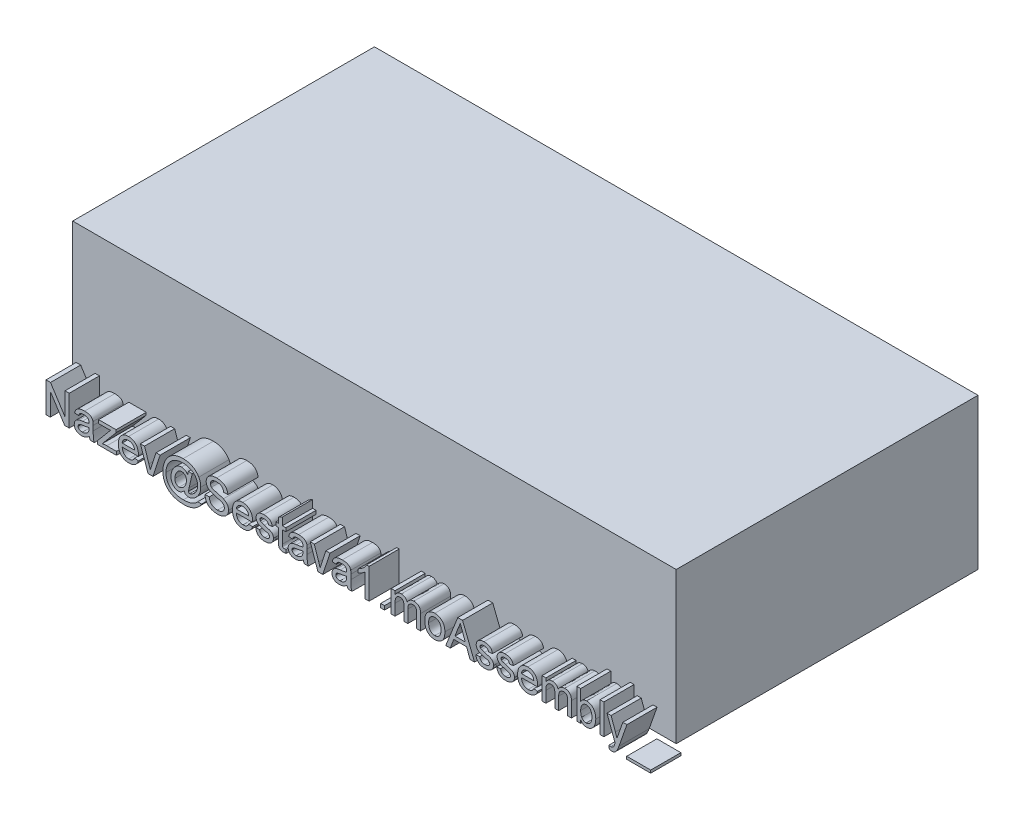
from build123d import *

# Parameters (mm, degrees)
SKICA1_W                = 20
SKICA1_H                = 10
P_IDAT_VYSUNUT_M1_DEPTH = 5
SKICA2_W                = 0.128205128
SKICA2_H                = 0.128205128
SKICA2_W_2              = 0.128205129
SKICA2_H_2              = 1
SKICA2_W_3              = 0.794871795
SKICA2_H_3              = 0.08974359
P_IDAT_VYSUNUT_M2_DEPTH = 1


with BuildPart() as part:
    # Skica1 → P_idat vysunut_m1 (new body)
    with BuildSketch(Plane(origin=(0, 0, 0), x_dir=(1, 0, 0), z_dir=(0, 1, 0))):
        Rectangle(SKICA1_W, SKICA1_H)
    extrude(amount=P_IDAT_VYSUNUT_M1_DEPTH)

    # Skica2 → P_idat vysunut_m2 (add)
    # profile 1 of 26: a face of its own
    with BuildSketch(Plane.XY.offset(5)):
        Polygon((-9.884615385, 0), (-9.884615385, 1), (-9.735576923, 1), (-9.256410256, 0.25380609), (-9.256410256, 1), (-9.115384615, 1), (-9.115384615, 0), (-9.264423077, 0), (-9.743589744, 0.74619391), (-9.743589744, 0), align=None)
    # profile 2 of 26: a face of its own
    with BuildSketch(Plane.XY.offset(5)):
        with BuildLine():
            add(Edge.make_bspline(
                [(-8.448717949, 0.08974359), (-8.459953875, 0.080906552), (-8.481601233, 0.06388094), (-8.51467088, 0.041843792), (-8.546631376, 0.023696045), (-8.578120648, 0.009820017), (-8.609724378, -0.000292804), (-8.641965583, -0.007505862), (-8.675348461, -0.012097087), (-8.698035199, -0.01257716), (-8.709535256, -0.012820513)],
                knots=[0, 0, 0, 0, 1.197047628, 2.306255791, 3.325459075, 4.272204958, 5.183179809, 6.100503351, 7.037132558, 8, 8, 8, 8], degree=3))
            add(Edge.make_bspline(
                [(-8.709535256, -0.012820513), (-8.718888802, -0.012602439), (-8.737031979, -0.012179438), (-8.763443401, -0.009652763), (-8.788171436, -0.005047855), (-8.811257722, 0.001416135), (-8.832864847, 0.009265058), (-8.852608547, 0.019436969), (-8.870758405, 0.031216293), (-8.886992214, 0.044919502), (-8.901381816, 0.059982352), (-8.914123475, 0.076002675), (-8.924762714, 0.093194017), (-8.933665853, 0.111270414), (-8.940530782, 0.130488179), (-8.945269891, 0.150717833), (-8.948121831, 0.171927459), (-8.948516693, 0.186355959), (-8.948717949, 0.193709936)],
                knots=[0, 0, 0, 0, 1.258692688, 2.441500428, 3.565802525, 4.638326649, 5.664695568, 6.653201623, 7.620115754, 8.570354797, 9.504485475, 10.41940588, 11.319425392, 12.219534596, 13.126122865, 14.058869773, 15.010636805, 16, 16, 16, 16], degree=3))
            add(Edge.make_bspline(
                [(-8.948717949, 0.193709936), (-8.948478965, 0.202411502), (-8.948008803, 0.21953045), (-8.943382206, 0.244533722), (-8.936253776, 0.268414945), (-8.925926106, 0.290794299), (-8.913395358, 0.311543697), (-8.898827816, 0.330316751), (-8.882646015, 0.347103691), (-8.864329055, 0.361354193), (-8.844675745, 0.373658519), (-8.823892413, 0.384612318), (-8.801887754, 0.393825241), (-8.786566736, 0.398623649), (-8.778846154, 0.401041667)],
                knots=[0, 0, 0, 0, 1.081160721, 2.127011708, 3.15154375, 4.173548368, 5.183333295, 6.160067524, 7.123185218, 8.075175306, 9.03822139, 10.004020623, 10.994184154, 12, 12, 12, 12], degree=3))
            add(Edge.make_bspline(
                [(-8.778846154, 0.401041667), (-8.772318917, 0.402719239), (-8.7578237, 0.40644467), (-8.733619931, 0.410739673), (-8.705067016, 0.415483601), (-8.68450673, 0.418078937), (-8.673477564, 0.419471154)],
                knots=[0, 0, 0, 0, 0.755247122, 1.677198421, 2.753978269, 4, 4, 4, 4], degree=3))
            add(Edge.make_bspline(
                [(-8.673477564, 0.419471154), (-8.661923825, 0.420991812), (-8.639603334, 0.423929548), (-8.607246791, 0.428438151), (-8.577267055, 0.433446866), (-8.549643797, 0.438715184), (-8.524330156, 0.443759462), (-8.501507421, 0.449422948), (-8.480964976, 0.45514885), (-8.468199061, 0.45948175), (-8.462139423, 0.461538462)],
                knots=[0, 0, 0, 0, 1.295688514, 2.50312072, 3.632112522, 4.674678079, 5.629835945, 6.501350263, 7.28863104, 8, 8, 8, 8], degree=3))
            add(Edge.make_bspline(
                [(-8.462139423, 0.461538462), (-8.462071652, 0.465077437), (-8.461948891, 0.471487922), (-8.461798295, 0.480036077), (-8.461503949, 0.486443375), (-8.461528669, 0.489983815), (-8.461538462, 0.491386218)],
                knots=[0, 0, 0, 0, 1.422721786, 2.577112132, 3.436380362, 4, 4, 4, 4], degree=3))
            add(Edge.make_bspline(
                [(-8.461538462, 0.491386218), (-8.461683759, 0.496997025), (-8.461962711, 0.50776899), (-8.463246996, 0.523329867), (-8.465885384, 0.53759803), (-8.469440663, 0.550620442), (-8.473952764, 0.562423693), (-8.479929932, 0.572634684), (-8.486460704, 0.581955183), (-8.491891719, 0.587023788), (-8.494591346, 0.589543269)],
                knots=[0, 0, 0, 0, 1.26154989, 2.42199954, 3.505345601, 4.517638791, 5.454101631, 6.334651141, 7.172195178, 8, 8, 8, 8], degree=3))
            add(Edge.make_bspline(
                [(-8.494591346, 0.589543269), (-8.498452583, 0.592661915), (-8.50634791, 0.599038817), (-8.519939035, 0.606614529), (-8.534508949, 0.613563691), (-8.550599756, 0.618949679), (-8.567971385, 0.623086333), (-8.586721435, 0.626070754), (-8.606801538, 0.627887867), (-8.620655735, 0.628097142), (-8.627804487, 0.628205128)],
                knots=[0, 0, 0, 0, 0.839762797, 1.717118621, 2.62848608, 3.573318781, 4.586191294, 5.652292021, 6.78858503, 8, 8, 8, 8], degree=3))
            add(Edge.make_bspline(
                [(-8.627804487, 0.628205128), (-8.634484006, 0.628136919), (-8.647320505, 0.628005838), (-8.665970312, 0.626761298), (-8.683232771, 0.624845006), (-8.699225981, 0.622035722), (-8.713741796, 0.61846319), (-8.727053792, 0.614256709), (-8.738976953, 0.609158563), (-8.753150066, 0.600969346), (-8.769098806, 0.587845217), (-8.784713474, 0.567062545), (-8.798419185, 0.541979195), (-8.804484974, 0.522905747), (-8.807692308, 0.512820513)],
                knots=[0, 0, 0, 0, 1.022193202, 1.964420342, 2.859404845, 3.679355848, 4.447752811, 5.145854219, 5.814144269, 6.427678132, 7.647232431, 8.943346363, 10.383770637, 12, 12, 12, 12], degree=3))
            Line((-8.807692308, 0.512820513), (-8.935897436, 0.525641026))
            add(Edge.make_bspline(
                [(-8.935897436, 0.525641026), (-8.932955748, 0.537670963), (-8.927275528, 0.560900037), (-8.914777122, 0.593297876), (-8.899649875, 0.622069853), (-8.881927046, 0.647754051), (-8.860142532, 0.669907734), (-8.834590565, 0.689408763), (-8.804604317, 0.705666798), (-8.77081242, 0.719461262), (-8.733479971, 0.730336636), (-8.693038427, 0.738066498), (-8.649813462, 0.742683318), (-8.620070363, 0.743281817), (-8.604767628, 0.743589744)],
                knots=[0, 0, 0, 0, 1.021253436, 1.971977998, 2.856928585, 3.699335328, 4.537187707, 5.410097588, 6.342486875, 7.343316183, 8.417452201, 9.545747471, 10.737294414, 12, 12, 12, 12], degree=3))
            add(Edge.make_bspline(
                [(-8.604767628, 0.743589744), (-8.589801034, 0.743328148), (-8.561278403, 0.742829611), (-8.520732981, 0.73891919), (-8.484530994, 0.732276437), (-8.452755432, 0.722653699), (-8.425133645, 0.710948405), (-8.401285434, 0.698067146), (-8.381322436, 0.683583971), (-8.36505115, 0.66740621), (-8.351997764, 0.649307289), (-8.341445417, 0.629282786), (-8.332631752, 0.607211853), (-8.328736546, 0.591471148), (-8.326722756, 0.583333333)],
                knots=[0, 0, 0, 0, 1.532418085, 2.920410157, 4.166262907, 5.295392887, 6.3126657, 7.233843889, 8.065362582, 8.82930282, 9.573337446, 10.341184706, 11.142406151, 12, 12, 12, 12], degree=3))
            add(Edge.make_bspline(
                [(-8.326722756, 0.583333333), (-8.325687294, 0.577135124), (-8.323304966, 0.562874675), (-8.321973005, 0.538338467), (-8.320641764, 0.508028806), (-8.320558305, 0.485847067), (-8.320512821, 0.473758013)],
                knots=[0, 0, 0, 0, 0.685842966, 1.577944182, 2.67997895, 4, 4, 4, 4], degree=3))
            Line((-8.320512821, 0.473758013), (-8.320512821, 0.317307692))
            add(Edge.make_bspline(
                [(-8.320512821, 0.317307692), (-8.320439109, 0.304220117), (-8.320298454, 0.279246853), (-8.320205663, 0.243520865), (-8.319654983, 0.211330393), (-8.318539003, 0.182557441), (-8.317617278, 0.157244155), (-8.316503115, 0.135327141), (-8.314913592, 0.116958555), (-8.312561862, 0.097123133), (-8.308461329, 0.074881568), (-8.301514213, 0.049362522), (-8.293071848, 0.024216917), (-8.285732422, 0.008089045), (-8.282051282, 0)],
                knots=[0, 0, 0, 0, 1.460752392, 2.787357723, 3.987454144, 5.053844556, 6.001073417, 6.814649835, 7.502887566, 8.058452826, 9.043678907, 10.023506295, 11.008675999, 12, 12, 12, 12], degree=3))
            Line((-8.282051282, 0), (-8.41025641, 0))
            add(Edge.make_bspline(
                [(-8.41025641, 0), (-8.415001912, 0.006552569), (-8.42448577, 0.019647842), (-8.435102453, 0.041686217), (-8.443843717, 0.064960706), (-8.447077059, 0.081400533), (-8.448717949, 0.08974359)],
                knots=[0, 0, 0, 0, 0.98283144, 1.964183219, 2.966842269, 4, 4, 4, 4], degree=3))
        make_face()
        with BuildLine():
            add(Edge.make_bspline(
                [(-8.461538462, 0.346153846), (-8.467190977, 0.344143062), (-8.479119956, 0.339899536), (-8.498360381, 0.334790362), (-8.519382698, 0.329179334), (-8.542569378, 0.324357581), (-8.567634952, 0.319251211), (-8.594846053, 0.314721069), (-8.623963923, 0.3103219), (-8.644092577, 0.307659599), (-8.654447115, 0.306290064)],
                knots=[0, 0, 0, 0, 0.729352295, 1.539213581, 2.419656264, 3.375381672, 4.41857158, 5.530700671, 6.729748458, 8, 8, 8, 8], degree=3))
            add(Edge.make_bspline(
                [(-8.654447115, 0.306290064), (-8.665746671, 0.304785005), (-8.686602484, 0.302007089), (-8.715069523, 0.296817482), (-8.738241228, 0.291528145), (-8.756756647, 0.285939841), (-8.771800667, 0.279350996), (-8.784262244, 0.271166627), (-8.795306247, 0.261987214), (-8.804278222, 0.251248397), (-8.811606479, 0.239711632), (-8.81654406, 0.22724605), (-8.820024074, 0.214331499), (-8.820348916, 0.205418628), (-8.820512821, 0.200921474)],
                knots=[0, 0, 0, 0, 1.886220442, 3.481434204, 4.78676141, 5.817751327, 6.678319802, 7.493641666, 8.277504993, 9.045791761, 9.800124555, 10.528599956, 11.257578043, 12, 12, 12, 12], degree=3))
            add(Edge.make_bspline(
                [(-8.820512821, 0.200921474), (-8.820135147, 0.194111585), (-8.81939287, 0.180727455), (-8.81208336, 0.161811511), (-8.800708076, 0.144702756), (-8.784888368, 0.129572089), (-8.76451731, 0.117347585), (-8.739972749, 0.108566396), (-8.711410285, 0.103503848), (-8.691060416, 0.102889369), (-8.680288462, 0.102564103)],
                knots=[0, 0, 0, 0, 0.849267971, 1.669148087, 2.501462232, 3.405991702, 4.385156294, 5.453560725, 6.652073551, 8, 8, 8, 8], degree=3))
            add(Edge.make_bspline(
                [(-8.680288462, 0.102564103), (-8.669240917, 0.102854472), (-8.647585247, 0.103423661), (-8.616120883, 0.109550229), (-8.58639266, 0.118806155), (-8.559070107, 0.132163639), (-8.534382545, 0.147983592), (-8.513010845, 0.165909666), (-8.494809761, 0.185457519), (-8.485686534, 0.200222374), (-8.481169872, 0.207532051)],
                knots=[0, 0, 0, 0, 1.124426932, 2.204129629, 3.254288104, 4.289056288, 5.293189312, 6.235005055, 7.126199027, 8, 8, 8, 8], degree=3))
            add(Edge.make_bspline(
                [(-8.481169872, 0.207532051), (-8.47812418, 0.213855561), (-8.471574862, 0.227453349), (-8.466421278, 0.251265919), (-8.462651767, 0.278720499), (-8.462317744, 0.298392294), (-8.462139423, 0.308894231)],
                knots=[0, 0, 0, 0, 0.806621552, 1.73452216, 2.790557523, 4, 4, 4, 4], degree=3))
            Line((-8.462139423, 0.308894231), (-8.461538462, 0.346153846))
        make_face(mode=Mode.SUBTRACT)
    # profile 3 of 26: a face of its own
    with BuildSketch(Plane.XY.offset(5)):
        with BuildLine():
            Line((-8.178084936, 0), (-8.178084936, 0.108774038))
            Line((-8.178084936, 0.108774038), (-7.740985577, 0.628205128))
            add(Edge.make_bspline(
                [(-7.740985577, 0.628205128), (-7.752657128, 0.626241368), (-7.775209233, 0.622446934), (-7.808092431, 0.618478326), (-7.838833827, 0.615890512), (-7.858635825, 0.615549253), (-7.868189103, 0.615384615)],
                knots=[0, 0, 0, 0, 1.109452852, 2.143716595, 3.10445447, 4, 4, 4, 4], degree=3))
            Line((-7.868189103, 0.615384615), (-8.139623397, 0.615384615))
            Line((-8.139623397, 0.615384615), (-8.139623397, 0.730769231))
            Line((-8.139623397, 0.730769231), (-7.562700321, 0.730769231))
            Line((-7.562700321, 0.730769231), (-7.562700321, 0.643629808))
            Line((-7.562700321, 0.643629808), (-7.962540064, 0.168469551))
            Line((-7.962540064, 0.168469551), (-8.018028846, 0.102564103))
            add(Edge.make_bspline(
                [(-8.018028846, 0.102564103), (-8.005088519, 0.104538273), (-7.979666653, 0.108416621), (-7.942035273, 0.112341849), (-7.905618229, 0.114908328), (-7.881748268, 0.115227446), (-7.869991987, 0.115384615)],
                knots=[0, 0, 0, 0, 1.055927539, 2.074418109, 3.051624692, 4, 4, 4, 4], degree=3))
            Line((-7.869991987, 0.115384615), (-7.549879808, 0.115384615))
            Line((-7.549879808, 0.115384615), (-7.549879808, 0))
            Line((-7.549879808, 0), (-8.178084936, 0))
        make_face()
    # profile 4 of 26: a face of its own
    with BuildSketch(Plane.XY.offset(5)):
        with BuildLine():
            Line((-6.950120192, 0.217948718), (-6.824519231, 0.205128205))
            add(Edge.make_bspline(
                [(-6.824519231, 0.205128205), (-6.827094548, 0.1966561), (-6.832160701, 0.179989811), (-6.842439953, 0.156351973), (-6.853735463, 0.133894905), (-6.867080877, 0.113107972), (-6.88172404, 0.093548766), (-6.897955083, 0.075373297), (-6.916128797, 0.059040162), (-6.93556966, 0.043867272), (-6.956601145, 0.030532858), (-6.979001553, 0.018760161), (-7.002852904, 0.00904417), (-7.028087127, 0.000950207), (-7.054761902, -0.005223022), (-7.08282774, -0.009487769), (-7.112247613, -0.01250918), (-7.132336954, -0.012715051), (-7.142628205, -0.012820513)],
                knots=[0, 0, 0, 0, 1.017198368, 2.001028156, 2.958938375, 3.904526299, 4.836491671, 5.766019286, 6.700699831, 7.641977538, 8.598163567, 9.559604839, 10.547559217, 11.555094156, 12.60347703, 13.691418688, 14.817373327, 16, 16, 16, 16], degree=3))
            add(Edge.make_bspline(
                [(-7.142628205, -0.012820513), (-7.155530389, -0.012517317), (-7.180685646, -0.01192618), (-7.217421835, -0.007183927), (-7.25212219, 0.000317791), (-7.284862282, 0.010946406), (-7.315432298, 0.024797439), (-7.343909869, 0.041832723), (-7.370472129, 0.061658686), (-7.394736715, 0.08462448), (-7.416690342, 0.110220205), (-7.435439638, 0.138680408), (-7.451700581, 0.169323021), (-7.464633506, 0.2026458), (-7.474855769, 0.238315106), (-7.481948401, 0.276482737), (-7.486486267, 0.316997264), (-7.486944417, 0.344872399), (-7.487179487, 0.359174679)],
                knots=[0, 0, 0, 0, 1.077616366, 2.10101772, 3.089143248, 4.040031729, 4.971276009, 5.886882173, 6.807369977, 7.734796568, 8.672701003, 9.618074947, 10.576315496, 11.565652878, 12.598619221, 13.67195277, 14.805516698, 16, 16, 16, 16], degree=3))
            add(Edge.make_bspline(
                [(-7.487179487, 0.359174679), (-7.486942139, 0.374009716), (-7.486481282, 0.402814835), (-7.482001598, 0.444755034), (-7.474593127, 0.484132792), (-7.464540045, 0.521090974), (-7.451219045, 0.555451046), (-7.434965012, 0.587200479), (-7.415878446, 0.616511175), (-7.393774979, 0.642953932), (-7.369317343, 0.666467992), (-7.343282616, 0.687377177), (-7.315124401, 0.704632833), (-7.285418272, 0.718959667), (-7.253877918, 0.729966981), (-7.220697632, 0.738073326), (-7.18562477, 0.742647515), (-7.161671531, 0.743271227), (-7.149439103, 0.743589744)],
                knots=[0, 0, 0, 0, 1.232307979, 2.392766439, 3.499416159, 4.558769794, 5.570548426, 6.555643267, 7.517416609, 8.470735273, 9.412423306, 10.33263532, 11.239503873, 12.150233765, 13.067967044, 14.009932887, 14.983713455, 16, 16, 16, 16], degree=3))
            add(Edge.make_bspline(
                [(-7.149439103, 0.743589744), (-7.137603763, 0.743285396), (-7.114441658, 0.742689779), (-7.080508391, 0.737909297), (-7.048174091, 0.730438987), (-7.017506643, 0.71958877), (-6.988660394, 0.705346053), (-6.961323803, 0.688347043), (-6.935687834, 0.668099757), (-6.911916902, 0.64488008), (-6.890258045, 0.618948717), (-6.871522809, 0.590205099), (-6.855658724, 0.559053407), (-6.84279851, 0.525255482), (-6.832899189, 0.489006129), (-6.825727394, 0.450281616), (-6.821204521, 0.40909511), (-6.820747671, 0.380754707), (-6.820512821, 0.366185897)],
                knots=[0, 0, 0, 0, 1.005323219, 1.967446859, 2.906060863, 3.821317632, 4.724696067, 5.63467896, 6.55185077, 7.494776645, 8.453732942, 9.416859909, 10.403972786, 11.418730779, 12.484189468, 13.592581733, 14.76243057, 16, 16, 16, 16], degree=3))
            add(Edge.make_bspline(
                [(-6.820512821, 0.366185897), (-6.820573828, 0.361645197), (-6.820720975, 0.350693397), (-6.820968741, 0.339743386), (-6.821113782, 0.333333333)],
                knots=[0, 0, 0, 0, 0.829215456, 2, 2, 2, 2], degree=3))
            Line((-6.821113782, 0.333333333), (-7.358974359, 0.333333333))
            add(Edge.make_bspline(
                [(-7.358974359, 0.333333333), (-7.358232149, 0.324304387), (-7.35678009, 0.30664016), (-7.352545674, 0.281065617), (-7.346831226, 0.25703079), (-7.339138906, 0.234747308), (-7.330051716, 0.213965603), (-7.318821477, 0.195027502), (-7.306310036, 0.177512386), (-7.291934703, 0.161847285), (-7.276420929, 0.147913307), (-7.259819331, 0.135690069), (-7.242159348, 0.12555186), (-7.223696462, 0.117028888), (-7.204258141, 0.110615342), (-7.183933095, 0.106025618), (-7.162607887, 0.103154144), (-7.148045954, 0.102763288), (-7.140625, 0.102564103)],
                knots=[0, 0, 0, 0, 1.224729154, 2.396059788, 3.502114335, 4.561587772, 5.580251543, 6.563724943, 7.533714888, 8.486186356, 9.43260269, 10.350144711, 11.268619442, 12.181885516, 13.095687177, 14.031096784, 14.996620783, 16, 16, 16, 16], degree=3))
            add(Edge.make_bspline(
                [(-7.140625, 0.102564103), (-7.12978988, 0.10292688), (-7.108799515, 0.103629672), (-7.078512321, 0.108560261), (-7.050749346, 0.117253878), (-7.025315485, 0.129321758), (-7.002252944, 0.145318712), (-6.982128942, 0.165794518), (-6.964237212, 0.190062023), (-6.954931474, 0.208444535), (-6.950120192, 0.217948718)],
                knots=[0, 0, 0, 0, 1.096312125, 2.123833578, 3.094060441, 4.030938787, 4.962563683, 5.918139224, 6.923629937, 8, 8, 8, 8], degree=3))
        make_face()
        with BuildLine():
            Line((-7.358974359, 0.448717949), (-6.948717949, 0.448717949))
            add(Edge.make_bspline(
                [(-6.948717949, 0.448717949), (-6.949524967, 0.455070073), (-6.951102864, 0.467489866), (-6.954424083, 0.485453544), (-6.958853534, 0.502190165), (-6.964188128, 0.517636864), (-6.970693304, 0.531823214), (-6.978043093, 0.544770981), (-6.986255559, 0.55661844), (-6.992638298, 0.563503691), (-6.995793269, 0.566907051)],
                knots=[0, 0, 0, 0, 1.185316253, 2.317552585, 3.379013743, 4.387694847, 5.339152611, 6.263729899, 7.141766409, 8, 8, 8, 8], degree=3))
            add(Edge.make_bspline(
                [(-6.995793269, 0.566907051), (-7.000834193, 0.571827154), (-7.01079088, 0.581545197), (-7.027391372, 0.594072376), (-7.045231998, 0.604461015), (-7.063965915, 0.613424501), (-7.08401215, 0.619918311), (-7.10496935, 0.624824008), (-7.127129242, 0.627603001), (-7.142286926, 0.628001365), (-7.150040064, 0.628205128)],
                knots=[0, 0, 0, 0, 0.989486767, 1.954405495, 2.91383024, 3.888017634, 4.867526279, 5.869356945, 6.910178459, 8, 8, 8, 8], degree=3))
            add(Edge.make_bspline(
                [(-7.150040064, 0.628205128), (-7.157057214, 0.628042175), (-7.170792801, 0.627723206), (-7.191028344, 0.62547862), (-7.210422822, 0.621757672), (-7.228941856, 0.616236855), (-7.24665309, 0.609526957), (-7.26343199, 0.600949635), (-7.279396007, 0.590983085), (-7.294481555, 0.579582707), (-7.308128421, 0.566806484), (-7.320608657, 0.553196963), (-7.330941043, 0.538155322), (-7.340102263, 0.522382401), (-7.34727556, 0.505385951), (-7.352922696, 0.487416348), (-7.356942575, 0.468424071), (-7.358291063, 0.455345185), (-7.358974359, 0.448717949)],
                knots=[0, 0, 0, 0, 1.10270868, 2.158476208, 3.195774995, 4.201977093, 5.192014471, 6.168217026, 7.158254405, 8.146844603, 9.134487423, 10.093158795, 11.042305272, 11.996428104, 12.955501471, 13.934632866, 14.95345241, 16, 16, 16, 16], degree=3))
        make_face(mode=Mode.SUBTRACT)
    # profile 5 of 26: a face of its own
    with BuildSketch(Plane.XY.offset(5)):
        with BuildLine():
            Line((-6.502403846, 0), (-6.756410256, 0.730769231))
            Line((-6.756410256, 0.730769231), (-6.620793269, 0.730769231))
            Line((-6.620793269, 0.730769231), (-6.475160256, 0.29306891))
            add(Edge.make_bspline(
                [(-6.475160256, 0.29306891), (-6.467005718, 0.269028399), (-6.450493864, 0.220349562), (-6.436546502, 0.170874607), (-6.429487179, 0.145833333)],
                knots=[0, 0, 0, 0, 0.987719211, 2, 2, 2, 2], degree=3))
            add(Edge.make_bspline(
                [(-6.429487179, 0.145833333), (-6.426597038, 0.155997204), (-6.420529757, 0.177334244), (-6.409983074, 0.210621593), (-6.398021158, 0.246836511), (-6.389201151, 0.271850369), (-6.384615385, 0.284855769)],
                knots=[0, 0, 0, 0, 0.867787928, 1.821749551, 2.867466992, 4, 4, 4, 4], degree=3))
            Line((-6.384615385, 0.284855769), (-6.23818109, 0.730769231))
            Line((-6.23818109, 0.730769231), (-6.102564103, 0.730769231))
            Line((-6.102564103, 0.730769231), (-6.33994391, 0))
            Line((-6.33994391, 0), (-6.502403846, 0))
        make_face()
    # profile 6 of 26: a face of its own
    with BuildSketch(Plane.XY.offset(5)):
        with BuildLine():
            add(Edge.make_bspline(
                [(-5.294871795, 0.113581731), (-5.302200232, 0.105289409), (-5.316669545, 0.088916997), (-5.340746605, 0.06715525), (-5.365787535, 0.047521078), (-5.392081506, 0.030815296), (-5.418877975, 0.017079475), (-5.446127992, 0.007306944), (-5.473424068, 0.001246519), (-5.491757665, 0.000411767), (-5.500801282, 0)],
                knots=[0, 0, 0, 0, 1.09533486, 2.162636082, 3.209077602, 4.243875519, 5.243607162, 6.184997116, 7.104693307, 8, 8, 8, 8], degree=3))
            add(Edge.make_bspline(
                [(-5.500801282, 0), (-5.510717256, 0.000432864), (-5.530634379, 0.00130231), (-5.560198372, 0.00815149), (-5.589060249, 0.019739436), (-5.617597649, 0.034947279), (-5.644542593, 0.055287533), (-5.668909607, 0.080623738), (-5.69048131, 0.110806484), (-5.709203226, 0.145113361), (-5.724563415, 0.182722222), (-5.735529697, 0.222597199), (-5.74239386, 0.264252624), (-5.743186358, 0.292641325), (-5.743589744, 0.307091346)],
                knots=[0, 0, 0, 0, 0.820897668, 1.648846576, 2.49831845, 3.391815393, 4.319978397, 5.282274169, 6.292453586, 7.384163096, 8.51301915, 9.649694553, 10.803680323, 12, 12, 12, 12], degree=3))
            add(Edge.make_bspline(
                [(-5.743589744, 0.307091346), (-5.743448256, 0.316178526), (-5.743164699, 0.33439036), (-5.74045969, 0.361695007), (-5.736012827, 0.38896933), (-5.729979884, 0.416251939), (-5.72238437, 0.443567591), (-5.712937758, 0.470857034), (-5.701636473, 0.4980823), (-5.688972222, 0.525144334), (-5.67484137, 0.551307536), (-5.659887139, 0.576169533), (-5.644060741, 0.599270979), (-5.627353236, 0.620571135), (-5.609922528, 0.640339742), (-5.591507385, 0.658263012), (-5.572446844, 0.674728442), (-5.55238847, 0.688921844), (-5.532261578, 0.701816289), (-5.511980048, 0.712790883), (-5.491926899, 0.722249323), (-5.47204124, 0.730180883), (-5.452202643, 0.736213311), (-5.432488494, 0.740367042), (-5.413007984, 0.743170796), (-5.400049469, 0.743450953), (-5.393629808, 0.743589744)],
                knots=[0, 0, 0, 0, 1.067804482, 2.140012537, 3.221230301, 4.314232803, 5.422457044, 6.551739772, 7.706025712, 8.885646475, 10.06194697, 11.199273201, 12.294246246, 13.350830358, 14.37929213, 15.389353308, 16.369141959, 17.336212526, 18.274611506, 19.177178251, 20.044349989, 20.879427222, 21.691279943, 22.477854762, 23.245927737, 24, 24, 24, 24], degree=3))
            add(Edge.make_bspline(
                [(-5.393629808, 0.743589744), (-5.383988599, 0.74318093), (-5.364667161, 0.742361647), (-5.336095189, 0.736441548), (-5.308330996, 0.726325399), (-5.281226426, 0.712845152), (-5.255551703, 0.694961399), (-5.231184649, 0.673487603), (-5.209379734, 0.647263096), (-5.196654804, 0.627805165), (-5.190104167, 0.617788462)],
                knots=[0, 0, 0, 0, 0.923740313, 1.851219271, 2.782333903, 3.74966761, 4.743706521, 5.772586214, 6.853354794, 8, 8, 8, 8], degree=3))
            Line((-5.190104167, 0.617788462), (-5.166666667, 0.730769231))
            Line((-5.166666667, 0.730769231), (-5.038461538, 0.730769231))
            Line((-5.038461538, 0.730769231), (-5.14463141, 0.267828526))
            add(Edge.make_bspline(
                [(-5.14463141, 0.267828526), (-5.146386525, 0.260220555), (-5.149678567, 0.245950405), (-5.154025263, 0.225823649), (-5.157936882, 0.208498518), (-5.160804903, 0.193685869), (-5.163580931, 0.18173928), (-5.16511113, 0.172351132), (-5.166224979, 0.165751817), (-5.166546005, 0.162194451), (-5.166666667, 0.160857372)],
                knots=[0, 0, 0, 0, 1.715007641, 3.216812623, 4.522943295, 5.616025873, 6.530823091, 7.215646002, 7.705191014, 8, 8, 8, 8], degree=3))
            add(Edge.make_bspline(
                [(-5.166666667, 0.160857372), (-5.166542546, 0.157830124), (-5.166300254, 0.151920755), (-5.16347067, 0.143397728), (-5.15905206, 0.135571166), (-5.153026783, 0.128606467), (-5.145861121, 0.122774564), (-5.13768872, 0.118518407), (-5.128779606, 0.11577395), (-5.122549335, 0.115515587), (-5.119391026, 0.115384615)],
                knots=[0, 0, 0, 0, 0.994223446, 1.940783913, 2.926200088, 3.940676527, 4.958013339, 5.952236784, 6.961927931, 8, 8, 8, 8], degree=3))
            add(Edge.make_bspline(
                [(-5.119391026, 0.115384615), (-5.112920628, 0.115903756), (-5.098666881, 0.117047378), (-5.07661422, 0.125703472), (-5.051505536, 0.137837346), (-5.03472553, 0.149003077), (-5.025641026, 0.155048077)],
                knots=[0, 0, 0, 0, 0.752233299, 1.657107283, 2.731584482, 4, 4, 4, 4], degree=3))
            add(Edge.make_bspline(
                [(-5.025641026, 0.155048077), (-5.013228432, 0.164150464), (-4.988463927, 0.182310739), (-4.955803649, 0.215321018), (-4.927206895, 0.252648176), (-4.903050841, 0.293904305), (-4.88347564, 0.337625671), (-4.869413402, 0.382737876), (-4.860589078, 0.428541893), (-4.859512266, 0.45936322), (-4.858974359, 0.474759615)],
                knots=[0, 0, 0, 0, 0.985131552, 1.965446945, 2.96335688, 3.991486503, 5.022026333, 6.026218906, 7.014023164, 8, 8, 8, 8], degree=3))
            add(Edge.make_bspline(
                [(-4.858974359, 0.474759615), (-4.859202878, 0.483711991), (-4.859657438, 0.501519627), (-4.86220642, 0.528057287), (-4.866933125, 0.554051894), (-4.873082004, 0.579738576), (-4.881334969, 0.604888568), (-4.89134591, 0.629603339), (-4.903328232, 0.653760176), (-4.916818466, 0.677542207), (-4.932234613, 0.700489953), (-4.949275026, 0.72252988), (-4.968409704, 0.743056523), (-4.989094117, 0.762686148), (-5.011790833, 0.780800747), (-5.036193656, 0.797950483), (-5.062331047, 0.813925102), (-5.090164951, 0.828433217), (-5.119065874, 0.841681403), (-5.149019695, 0.853048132), (-5.179682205, 0.862919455), (-5.21110906, 0.870967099), (-5.243325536, 0.876902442), (-5.276218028, 0.88127146), (-5.309907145, 0.884274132), (-5.332659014, 0.884500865), (-5.344150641, 0.884615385)],
                knots=[0, 0, 0, 0, 0.909717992, 1.809567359, 2.705212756, 3.592105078, 4.491033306, 5.391802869, 6.298987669, 7.228821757, 8.167743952, 9.105488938, 10.056103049, 11.01596816, 12.000264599, 13.003457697, 14.044807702, 15.109951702, 16.190773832, 17.27306411, 18.362982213, 19.462130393, 20.566521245, 21.689099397, 22.832798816, 24, 24, 24, 24], degree=3))
            add(Edge.make_bspline(
                [(-5.344150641, 0.884615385), (-5.357243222, 0.884348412), (-5.383199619, 0.883819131), (-5.421693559, 0.88068971), (-5.459306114, 0.874898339), (-5.496168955, 0.867474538), (-5.532085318, 0.857391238), (-5.567060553, 0.845014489), (-5.601386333, 0.830953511), (-5.634516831, 0.814281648), (-5.6663287, 0.795725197), (-5.696500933, 0.775248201), (-5.724841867, 0.752836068), (-5.751076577, 0.728177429), (-5.775880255, 0.702017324), (-5.798460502, 0.673608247), (-5.819428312, 0.64348025), (-5.838268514, 0.611525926), (-5.855283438, 0.57845227), (-5.86990551, 0.544483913), (-5.88235027, 0.50996689), (-5.892650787, 0.47487145), (-5.900394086, 0.439170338), (-5.906034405, 0.40291996), (-5.909528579, 0.36605403), (-5.910012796, 0.341220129), (-5.91025641, 0.328725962)],
                knots=[0, 0, 0, 0, 1.061786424, 2.105020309, 3.128864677, 4.146202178, 5.15254315, 6.150928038, 7.153488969, 8.158430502, 9.155831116, 10.13803591, 11.11306527, 12.082364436, 13.055361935, 14.033768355, 15.022103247, 16.029667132, 17.039498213, 18.036310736, 19.026305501, 20.013304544, 20.999991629, 21.986366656, 22.986922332, 24, 24, 24, 24], degree=3))
            add(Edge.make_bspline(
                [(-5.91025641, 0.328725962), (-5.909995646, 0.315766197), (-5.909482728, 0.290274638), (-5.906326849, 0.252717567), (-5.900698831, 0.216585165), (-5.892843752, 0.181794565), (-5.882988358, 0.148295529), (-5.870327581, 0.116356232), (-5.856050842, 0.085537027), (-5.839117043, 0.056369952), (-5.820396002, 0.028657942), (-5.79934224, 0.002858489), (-5.776446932, -0.021151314), (-5.75129987, -0.043075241), (-5.724505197, -0.063409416), (-5.695477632, -0.081622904), (-5.664550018, -0.098093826), (-5.631752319, -0.112582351), (-5.597555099, -0.125374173), (-5.562266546, -0.136298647), (-5.526141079, -0.145832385), (-5.4889993, -0.153341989), (-5.450983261, -0.159426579), (-5.4120615, -0.163509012), (-5.37230265, -0.166279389), (-5.345490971, -0.166536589), (-5.33193109, -0.166666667)],
                knots=[0, 0, 0, 0, 1.080805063, 2.125918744, 3.140302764, 4.12782835, 5.098553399, 6.04887587, 6.990479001, 7.92843617, 8.858225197, 9.776605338, 10.702132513, 11.621474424, 12.555870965, 13.504429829, 14.47596909, 15.475588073, 16.492307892, 17.519103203, 18.555038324, 19.606718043, 20.67783993, 21.764439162, 22.869375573, 24, 24, 24, 24], degree=3))
            add(Edge.make_bspline(
                [(-5.33193109, -0.166666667), (-5.317572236, -0.166510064), (-5.289367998, -0.166202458), (-5.24797815, -0.163871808), (-5.208375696, -0.159518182), (-5.1705472, -0.154142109), (-5.13453568, -0.146606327), (-5.100327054, -0.137709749), (-5.067888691, -0.12703923), (-5.037301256, -0.114813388), (-5.008520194, -0.101418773), (-4.981632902, -0.087142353), (-4.956543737, -0.072333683), (-4.933211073, -0.056910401), (-4.911706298, -0.040754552), (-4.892304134, -0.023604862), (-4.874435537, -0.006101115), (-4.864074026, 0.006579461), (-4.858974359, 0.012820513)],
                knots=[0, 0, 0, 0, 1.318951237, 2.590737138, 3.805901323, 4.977803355, 6.098926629, 7.183480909, 8.223120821, 9.233396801, 10.207557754, 11.137702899, 12.028680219, 12.882660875, 13.705797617, 14.496865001, 15.260195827, 16, 16, 16, 16], degree=3))
            Line((-4.858974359, 0.012820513), (-4.730769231, 0.012820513))
            add(Edge.make_bspline(
                [(-4.730769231, 0.012820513), (-4.737215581, 0.000618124), (-4.750702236, -0.024910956), (-4.777972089, -0.061158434), (-4.810928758, -0.097934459), (-4.849244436, -0.134742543), (-4.892768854, -0.169893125), (-4.941069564, -0.201264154), (-4.993162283, -0.229071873), (-5.039576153, -0.248558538), (-5.078740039, -0.262321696), (-5.110105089, -0.270646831), (-5.142692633, -0.278497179), (-5.176918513, -0.28429192), (-5.212502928, -0.28927651), (-5.249634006, -0.292183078), (-5.288161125, -0.294681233), (-5.314365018, -0.294807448), (-5.327724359, -0.294871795)],
                knots=[0, 0, 0, 0, 0.936642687, 1.959585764, 3.071700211, 4.291332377, 5.566315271, 6.86777089, 8.199539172, 9.574222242, 10.284603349, 11.018931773, 11.778459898, 12.56183936, 13.376911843, 14.219574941, 15.092298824, 16, 16, 16, 16], degree=3))
            add(Edge.make_bspline(
                [(-5.327724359, -0.294871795), (-5.3523134, -0.294418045), (-5.400665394, -0.293525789), (-5.471739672, -0.286259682), (-5.539779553, -0.273921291), (-5.594427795, -0.260169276), (-5.636078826, -0.246007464), (-5.666167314, -0.234804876), (-5.694900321, -0.221822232), (-5.722484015, -0.207815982), (-5.749095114, -0.192856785), (-5.774322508, -0.176287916), (-5.798587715, -0.158799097), (-5.821401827, -0.139850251), (-5.843043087, -0.120104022), (-5.863211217, -0.099364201), (-5.882386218, -0.078255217), (-5.899779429, -0.056027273), (-5.916058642, -0.033337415), (-5.930673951, -0.009693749), (-5.944188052, 0.014440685), (-5.952020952, 0.031133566), (-5.955929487, 0.039463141)],
                knots=[0, 0, 0, 0, 1.955764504, 3.84582367, 5.675428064, 7.45333494, 8.321753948, 9.174104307, 10.00628854, 10.82822135, 11.634646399, 12.433178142, 13.227902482, 14.012748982, 14.790970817, 15.557227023, 16.31330816, 17.058261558, 17.801090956, 18.533612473, 19.268287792, 20, 20, 20, 20], degree=3))
            add(Edge.make_bspline(
                [(-5.955929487, 0.039463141), (-5.960546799, 0.050224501), (-5.969761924, 0.07170178), (-5.981034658, 0.104985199), (-5.99088825, 0.138717), (-5.998939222, 0.173150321), (-6.005153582, 0.208193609), (-6.009446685, 0.243910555), (-6.012478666, 0.280196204), (-6.012706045, 0.304614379), (-6.012820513, 0.316907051)],
                knots=[0, 0, 0, 0, 0.984798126, 1.965437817, 2.953898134, 3.9404251, 4.938796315, 5.946323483, 6.966131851, 8, 8, 8, 8], degree=3))
            add(Edge.make_bspline(
                [(-6.012820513, 0.316907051), (-6.012644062, 0.330668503), (-6.012293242, 0.35802905), (-6.008977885, 0.398825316), (-6.003544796, 0.439062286), (-5.996178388, 0.478874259), (-5.986470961, 0.518157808), (-5.974902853, 0.557041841), (-5.961145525, 0.595407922), (-5.950200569, 0.620319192), (-5.944711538, 0.6328125)],
                knots=[0, 0, 0, 0, 1.014081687, 2.016199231, 3.014260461, 4.005540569, 4.998614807, 5.995097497, 6.9945167, 8, 8, 8, 8], degree=3))
            add(Edge.make_bspline(
                [(-5.944711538, 0.6328125), (-5.937631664, 0.647803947), (-5.92365292, 0.677403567), (-5.899512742, 0.719493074), (-5.873196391, 0.758903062), (-5.844778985, 0.795682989), (-5.81396564, 0.829556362), (-5.781309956, 0.8610725), (-5.746084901, 0.88943382), (-5.708965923, 0.915429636), (-5.669697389, 0.938513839), (-5.628239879, 0.958356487), (-5.584837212, 0.975196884), (-5.539402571, 0.989113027), (-5.491883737, 0.99959581), (-5.442371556, 1.007202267), (-5.390848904, 1.011892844), (-5.355779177, 1.012507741), (-5.337940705, 1.012820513)],
                knots=[0, 0, 0, 0, 1.044360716, 2.062021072, 3.053931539, 4.028521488, 4.987704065, 5.9370077, 6.885229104, 7.834169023, 8.790310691, 9.75195405, 10.72707971, 11.721307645, 12.743117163, 13.79044013, 14.876091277, 16, 16, 16, 16], degree=3))
            add(Edge.make_bspline(
                [(-5.337940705, 1.012820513), (-5.324045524, 1.012646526), (-5.296551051, 1.012302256), (-5.255886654, 1.009006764), (-5.216283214, 1.003646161), (-5.177784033, 0.995957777), (-5.140278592, 0.986440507), (-5.103888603, 0.974559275), (-5.068654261, 0.960521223), (-5.03448844, 0.944490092), (-5.001751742, 0.926404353), (-4.970706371, 0.906016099), (-4.941386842, 0.88358753), (-4.913934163, 0.858866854), (-4.888221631, 0.83215871), (-4.864299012, 0.803392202), (-4.842172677, 0.772538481), (-4.829106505, 0.750632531), (-4.822516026, 0.739583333)],
                knots=[0, 0, 0, 0, 1.088140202, 2.153109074, 3.193037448, 4.216662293, 5.22636438, 6.22200397, 7.21260343, 8.195218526, 9.176120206, 10.139294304, 11.101658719, 12.064562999, 13.029949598, 14.002913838, 14.992684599, 16, 16, 16, 16], degree=3))
            add(Edge.make_bspline(
                [(-4.822516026, 0.739583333), (-4.817243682, 0.729766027), (-4.806750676, 0.710227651), (-4.793390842, 0.679868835), (-4.781929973, 0.648970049), (-4.772468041, 0.61747874), (-4.765181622, 0.585286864), (-4.760383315, 0.552457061), (-4.75689498, 0.519037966), (-4.756572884, 0.496537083), (-4.756410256, 0.485176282)],
                knots=[0, 0, 0, 0, 1.005876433, 2.001892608, 2.991960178, 3.98006145, 4.968861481, 5.969084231, 6.974581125, 8, 8, 8, 8], degree=3))
            add(Edge.make_bspline(
                [(-4.756410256, 0.485176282), (-4.756839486, 0.468996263), (-4.757687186, 0.437041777), (-4.764271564, 0.389800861), (-4.775138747, 0.344019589), (-4.790115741, 0.299437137), (-4.809996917, 0.256528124), (-4.833775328, 0.214803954), (-4.861734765, 0.174324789), (-4.88356297, 0.149305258), (-4.89463141, 0.13661859)],
                knots=[0, 0, 0, 0, 1.011119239, 1.996894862, 2.974863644, 3.948959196, 4.931371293, 5.925882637, 6.9482761, 8, 8, 8, 8], degree=3))
            add(Edge.make_bspline(
                [(-4.89463141, 0.13661859), (-4.90485721, 0.125737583), (-4.924717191, 0.104605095), (-4.956905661, 0.076976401), (-4.989257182, 0.052877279), (-5.023009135, 0.033944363), (-5.057110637, 0.01860962), (-5.092115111, 0.007994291), (-5.127814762, 0.001291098), (-5.151947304, 0.000431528), (-5.1640625, 0)],
                knots=[0, 0, 0, 0, 1.150024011, 2.233512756, 3.264943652, 4.253714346, 5.209954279, 6.141118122, 7.066790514, 8, 8, 8, 8], degree=3))
            add(Edge.make_bspline(
                [(-5.1640625, 0), (-5.171486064, 9.6794e-05), (-5.185658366, 0.000281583), (-5.205774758, 0.003213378), (-5.22377836, 0.00746494), (-5.239632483, 0.013636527), (-5.253193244, 0.021774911), (-5.264851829, 0.031316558), (-5.274639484, 0.042413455), (-5.279577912, 0.050858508), (-5.282051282, 0.055088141)],
                knots=[0, 0, 0, 0, 1.295646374, 2.473514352, 3.542939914, 4.52202898, 5.432266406, 6.294050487, 7.145589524, 8, 8, 8, 8], degree=3))
            add(Edge.make_bspline(
                [(-5.282051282, 0.055088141), (-5.283462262, 0.058399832), (-5.286665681, 0.065918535), (-5.290053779, 0.079126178), (-5.292761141, 0.095356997), (-5.294128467, 0.107163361), (-5.294871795, 0.113581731)],
                knots=[0, 0, 0, 0, 0.717483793, 1.628940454, 2.711005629, 4, 4, 4, 4], degree=3))
        make_face()
        with BuildLine():
            add(Edge.make_bspline(
                [(-5.615384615, 0.306490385), (-5.615294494, 0.299607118), (-5.615119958, 0.286276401), (-5.613049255, 0.266853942), (-5.60972672, 0.248606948), (-5.604862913, 0.231542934), (-5.59892283, 0.215579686), (-5.591407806, 0.200837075), (-5.582675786, 0.187222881), (-5.572541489, 0.174973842), (-5.561670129, 0.164035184), (-5.550076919, 0.154620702), (-5.538419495, 0.146224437), (-5.525947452, 0.139907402), (-5.513428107, 0.134567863), (-5.500358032, 0.130966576), (-5.486925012, 0.128698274), (-5.477773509, 0.128370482), (-5.473157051, 0.128205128)],
                knots=[0, 0, 0, 0, 1.297457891, 2.512766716, 3.678401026, 4.790509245, 5.854533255, 6.885024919, 7.904845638, 8.897966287, 9.877342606, 10.807569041, 11.712219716, 12.579561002, 13.437714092, 14.274825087, 15.129738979, 16, 16, 16, 16], degree=3))
            add(Edge.make_bspline(
                [(-5.473157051, 0.128205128), (-5.466857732, 0.128410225), (-5.454000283, 0.128828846), (-5.434620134, 0.133240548), (-5.41466735, 0.139636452), (-5.394306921, 0.148672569), (-5.373969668, 0.160266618), (-5.353975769, 0.174425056), (-5.334618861, 0.191201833), (-5.315441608, 0.210104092), (-5.297688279, 0.232014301), (-5.281337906, 0.256566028), (-5.267026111, 0.283985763), (-5.254341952, 0.313569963), (-5.243755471, 0.344457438), (-5.23642059, 0.376012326), (-5.231479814, 0.407495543), (-5.231005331, 0.428600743), (-5.230769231, 0.439102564)],
                knots=[0, 0, 0, 0, 0.699835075, 1.428423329, 2.201457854, 3.02978717, 3.901594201, 4.802456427, 5.750988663, 6.749202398, 7.794739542, 8.882787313, 10.026128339, 11.230992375, 12.462166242, 13.653391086, 14.832341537, 16, 16, 16, 16], degree=3))
            add(Edge.make_bspline(
                [(-5.230769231, 0.439102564), (-5.230833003, 0.445922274), (-5.230956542, 0.459133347), (-5.23338687, 0.478320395), (-5.236556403, 0.496423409), (-5.241711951, 0.513255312), (-5.247845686, 0.529119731), (-5.255678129, 0.543646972), (-5.264797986, 0.557140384), (-5.275361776, 0.569242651), (-5.286983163, 0.579938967), (-5.299070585, 0.589546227), (-5.311843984, 0.597531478), (-5.325317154, 0.603995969), (-5.339283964, 0.609275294), (-5.353948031, 0.612859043), (-5.369202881, 0.614848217), (-5.379534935, 0.615203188), (-5.384815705, 0.615384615)],
                knots=[0, 0, 0, 0, 1.243295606, 2.408499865, 3.524441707, 4.592255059, 5.61490492, 6.623302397, 7.596566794, 8.581128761, 9.546659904, 10.475278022, 11.394819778, 12.288490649, 13.19829466, 14.114358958, 15.036238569, 16, 16, 16, 16], degree=3))
            add(Edge.make_bspline(
                [(-5.384815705, 0.615384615), (-5.391846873, 0.61518245), (-5.405748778, 0.614782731), (-5.426235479, 0.610694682), (-5.446142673, 0.604600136), (-5.465451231, 0.595586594), (-5.484154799, 0.583814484), (-5.502663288, 0.569212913), (-5.520471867, 0.551200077), (-5.538322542, 0.530709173), (-5.555066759, 0.507475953), (-5.56988153, 0.481446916), (-5.583399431, 0.453287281), (-5.594418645, 0.423074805), (-5.603585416, 0.392509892), (-5.610201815, 0.36265328), (-5.614467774, 0.33412321), (-5.615085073, 0.315518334), (-5.615384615, 0.306490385)],
                knots=[0, 0, 0, 0, 0.797938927, 1.57767125, 2.364751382, 3.159075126, 3.990643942, 4.871035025, 5.831357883, 6.864143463, 7.9569145, 9.078668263, 10.263073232, 11.501830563, 12.728516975, 13.88638004, 14.974373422, 16, 16, 16, 16], degree=3))
        make_face(mode=Mode.SUBTRACT)
    # profile 7 of 26: a face of its own
    with BuildSketch(Plane.XY.offset(5)):
        with BuildLine():
            Line((-4.615384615, 0.346153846), (-4.474358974, 0.346153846))
            add(Edge.make_bspline(
                [(-4.474358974, 0.346153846), (-4.472807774, 0.333491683), (-4.469827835, 0.309166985), (-4.461495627, 0.274690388), (-4.450771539, 0.243692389), (-4.43740962, 0.21576159), (-4.419832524, 0.191232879), (-4.398655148, 0.169108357), (-4.372936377, 0.14994986), (-4.343905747, 0.132900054), (-4.311573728, 0.119513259), (-4.277056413, 0.109589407), (-4.240518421, 0.103709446), (-4.215499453, 0.10295125), (-4.202724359, 0.102564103)],
                knots=[0, 0, 0, 0, 1.125557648, 2.162256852, 3.1243583, 4.018160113, 4.88511607, 5.777380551, 6.711250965, 7.707237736, 8.743031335, 9.791730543, 10.872421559, 12, 12, 12, 12], degree=3))
            add(Edge.make_bspline(
                [(-4.202724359, 0.102564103), (-4.191419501, 0.102773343), (-4.169377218, 0.103181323), (-4.137490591, 0.108082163), (-4.107485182, 0.115033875), (-4.079919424, 0.125549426), (-4.054895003, 0.138318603), (-4.033164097, 0.153763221), (-4.014611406, 0.171180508), (-4.000083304, 0.191029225), (-3.988670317, 0.211827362), (-3.980297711, 0.233205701), (-3.975310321, 0.255045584), (-3.974674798, 0.269740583), (-3.974358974, 0.277043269)],
                knots=[0, 0, 0, 0, 1.267006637, 2.470417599, 3.611360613, 4.716023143, 5.771382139, 6.754486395, 7.697536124, 8.612899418, 9.501261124, 10.352596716, 11.181322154, 12, 12, 12, 12], degree=3))
            add(Edge.make_bspline(
                [(-3.974358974, 0.277043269), (-3.974696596, 0.284271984), (-3.975356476, 0.298400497), (-3.979656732, 0.318969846), (-3.987829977, 0.337796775), (-3.998435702, 0.355649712), (-4.013190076, 0.371972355), (-4.031830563, 0.387012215), (-4.054767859, 0.400647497), (-4.071887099, 0.408114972), (-4.080929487, 0.412059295)],
                knots=[0, 0, 0, 0, 0.942140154, 1.841411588, 2.718743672, 3.605002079, 4.535543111, 5.568170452, 6.715506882, 8, 8, 8, 8], degree=3))
            add(Edge.make_bspline(
                [(-4.080929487, 0.412059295), (-4.084452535, 0.413505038), (-4.092411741, 0.416771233), (-4.106053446, 0.421095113), (-4.122241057, 0.426686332), (-4.141363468, 0.432444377), (-4.163318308, 0.438535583), (-4.188069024, 0.445429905), (-4.215601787, 0.452761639), (-4.24513572, 0.460565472), (-4.274955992, 0.468500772), (-4.303445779, 0.476443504), (-4.329657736, 0.484506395), (-4.353806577, 0.492269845), (-4.375767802, 0.500065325), (-4.395603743, 0.507679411), (-4.41333913, 0.514957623), (-4.424171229, 0.520309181), (-4.429286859, 0.522836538)],
                knots=[0, 0, 0, 0, 0.499201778, 1.127787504, 1.87543728, 2.745208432, 3.745951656, 4.863402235, 6.114490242, 7.482339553, 8.869366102, 10.161191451, 11.360587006, 12.46547846, 13.487450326, 14.41601931, 15.251940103, 16, 16, 16, 16], degree=3))
            add(Edge.make_bspline(
                [(-4.429286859, 0.522836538), (-4.441056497, 0.529194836), (-4.46377496, 0.541468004), (-4.494351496, 0.563412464), (-4.520115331, 0.587763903), (-4.540957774, 0.614487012), (-4.55729118, 0.643129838), (-4.568311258, 0.673741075), (-4.575859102, 0.705765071), (-4.576564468, 0.727786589), (-4.576923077, 0.738982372)],
                knots=[0, 0, 0, 0, 1.158441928, 2.236094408, 3.251151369, 4.220012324, 5.163146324, 6.095083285, 7.031536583, 8, 8, 8, 8], degree=3))
            add(Edge.make_bspline(
                [(-4.576923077, 0.738982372), (-4.576447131, 0.751379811), (-4.575500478, 0.776038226), (-4.567103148, 0.812222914), (-4.553709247, 0.847042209), (-4.538462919, 0.874685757), (-4.52359438, 0.895589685), (-4.511268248, 0.910644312), (-4.497442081, 0.92456029), (-4.482541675, 0.937531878), (-4.466300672, 0.949365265), (-4.449122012, 0.960546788), (-4.430383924, 0.970157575), (-4.404054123, 0.982389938), (-4.368831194, 0.994605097), (-4.324489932, 1.005249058), (-4.27782221, 1.011517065), (-4.246012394, 1.012379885), (-4.229767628, 1.012820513)],
                knots=[0, 0, 0, 0, 1.199927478, 2.386647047, 3.578628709, 4.806592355, 5.433127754, 6.062729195, 6.689531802, 7.331674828, 7.974827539, 8.635320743, 9.315455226, 10.01318112, 11.447700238, 12.918145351, 14.426146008, 16, 16, 16, 16], degree=3))
            add(Edge.make_bspline(
                [(-4.229767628, 1.012820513), (-4.211986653, 1.012413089), (-4.177363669, 1.011619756), (-4.127055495, 1.005019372), (-4.080131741, 0.993684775), (-4.043332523, 0.980996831), (-4.016127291, 0.968152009), (-3.996799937, 0.958129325), (-3.97886033, 0.946541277), (-3.962146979, 0.934001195), (-3.946504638, 0.920514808), (-3.932335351, 0.905761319), (-3.919023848, 0.890244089), (-3.903380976, 0.867966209), (-3.886514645, 0.838481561), (-3.871931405, 0.800283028), (-3.86191255, 0.759967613), (-3.859963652, 0.732096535), (-3.858974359, 0.717948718)],
                knots=[0, 0, 0, 0, 1.607600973, 3.130308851, 4.577334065, 5.967726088, 6.640410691, 7.296826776, 7.935019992, 8.569057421, 9.185393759, 9.8003086, 10.417295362, 11.032210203, 12.259799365, 13.477607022, 14.719591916, 16, 16, 16, 16], degree=3))
            Line((-3.858974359, 0.717948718), (-4, 0.717948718))
            add(Edge.make_bspline(
                [(-4, 0.717948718), (-4.000896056, 0.725109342), (-4.002649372, 0.73912056), (-4.006999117, 0.759403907), (-4.013096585, 0.778242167), (-4.020238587, 0.79581102), (-4.02889619, 0.811927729), (-4.038988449, 0.826747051), (-4.050638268, 0.840094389), (-4.063545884, 0.852322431), (-4.078104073, 0.862969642), (-4.094238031, 0.872211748), (-4.111974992, 0.880019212), (-4.131299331, 0.886413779), (-4.152214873, 0.891371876), (-4.174769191, 0.895019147), (-4.198953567, 0.896887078), (-4.21560897, 0.897249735), (-4.224158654, 0.897435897)],
                knots=[0, 0, 0, 0, 1.074487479, 2.102453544, 3.083708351, 4.020042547, 4.923259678, 5.803182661, 6.684453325, 7.556870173, 8.445961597, 9.363679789, 10.320905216, 11.327237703, 12.390948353, 13.519046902, 14.726457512, 16, 16, 16, 16], degree=3))
            add(Edge.make_bspline(
                [(-4.224158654, 0.897435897), (-4.233045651, 0.897368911), (-4.250248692, 0.897239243), (-4.275117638, 0.89487555), (-4.298167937, 0.89163248), (-4.319359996, 0.886848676), (-4.338624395, 0.88058666), (-4.356247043, 0.873355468), (-4.371734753, 0.86419166), (-4.385448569, 0.853984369), (-4.397278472, 0.842690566), (-4.407474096, 0.830789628), (-4.416491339, 0.818631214), (-4.423497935, 0.805550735), (-4.429202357, 0.792043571), (-4.432882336, 0.77785583), (-4.435487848, 0.763249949), (-4.43575902, 0.753284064), (-4.435897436, 0.748197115)],
                knots=[0, 0, 0, 0, 1.464176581, 2.834285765, 4.113735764, 5.29917439, 6.409476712, 7.449999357, 8.431575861, 9.367089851, 10.262376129, 11.120706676, 11.948504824, 12.751342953, 13.560717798, 14.359016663, 15.162382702, 16, 16, 16, 16], degree=3))
            add(Edge.make_bspline(
                [(-4.435897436, 0.748197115), (-4.435532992, 0.739593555), (-4.434825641, 0.722894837), (-4.427602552, 0.699170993), (-4.41649339, 0.677545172), (-4.405549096, 0.665778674), (-4.400040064, 0.659855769)],
                knots=[0, 0, 0, 0, 1.050964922, 2.039826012, 3.013306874, 4, 4, 4, 4], degree=3))
            add(Edge.make_bspline(
                [(-4.400040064, 0.659855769), (-4.396567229, 0.656895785), (-4.38888727, 0.650349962), (-4.374597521, 0.641687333), (-4.356880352, 0.63293485), (-4.33561738, 0.624234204), (-4.310845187, 0.615479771), (-4.282603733, 0.606466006), (-4.250785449, 0.597513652), (-4.216359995, 0.588886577), (-4.18158226, 0.580224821), (-4.148531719, 0.571596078), (-4.118185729, 0.563418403), (-4.090592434, 0.555442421), (-4.065723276, 0.547690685), (-4.043664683, 0.540000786), (-4.024238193, 0.53292803), (-4.012337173, 0.527951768), (-4.006810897, 0.525641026)],
                knots=[0, 0, 0, 0, 0.523891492, 1.158553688, 1.913783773, 2.794766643, 3.797521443, 4.933638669, 6.202080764, 7.596537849, 9.013317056, 10.322179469, 11.523240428, 12.626146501, 13.623953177, 14.517289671, 15.311498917, 16, 16, 16, 16], degree=3))
            add(Edge.make_bspline(
                [(-4.006810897, 0.525641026), (-3.999620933, 0.52232599), (-3.985508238, 0.515819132), (-3.965515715, 0.504709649), (-3.946860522, 0.493173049), (-3.929693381, 0.480898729), (-3.914069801, 0.467860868), (-3.899815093, 0.454208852), (-3.886843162, 0.440019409), (-3.875677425, 0.424838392), (-3.865651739, 0.409279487), (-3.856878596, 0.393125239), (-3.84981463, 0.376280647), (-3.843619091, 0.358948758), (-3.839162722, 0.340936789), (-3.835668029, 0.322426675), (-3.833629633, 0.303331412), (-3.833432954, 0.290402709), (-3.833333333, 0.283854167)],
                knots=[0, 0, 0, 0, 1.198900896, 2.353241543, 3.461831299, 4.520043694, 5.547003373, 6.541368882, 7.508191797, 8.454912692, 9.392021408, 10.310662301, 11.235020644, 12.156274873, 13.095836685, 14.042125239, 15.00831306, 16, 16, 16, 16], degree=3))
            add(Edge.make_bspline(
                [(-3.833333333, 0.283854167), (-3.833855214, 0.270785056), (-3.834891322, 0.244838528), (-3.84381258, 0.206592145), (-3.857827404, 0.169531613), (-3.874263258, 0.14012204), (-3.889800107, 0.1176574), (-3.902851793, 0.101510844), (-3.917325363, 0.086580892), (-3.932864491, 0.072399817), (-3.949589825, 0.05925696), (-3.967642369, 0.047147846), (-3.986831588, 0.035946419), (-4.01423331, 0.022296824), (-4.050627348, 0.008018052), (-4.096986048, -0.003872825), (-4.145842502, -0.011586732), (-4.179390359, -0.012403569), (-4.196514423, -0.012820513)],
                knots=[0, 0, 0, 0, 1.197055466, 2.376552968, 3.581957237, 4.820753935, 5.454298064, 6.085440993, 6.72202542, 7.359198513, 8.013298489, 8.67051481, 9.351020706, 10.049282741, 11.476266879, 12.925760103, 14.430794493, 16, 16, 16, 16], degree=3))
            add(Edge.make_bspline(
                [(-4.196514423, -0.012820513), (-4.207402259, -0.012730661), (-4.228729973, -0.012554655), (-4.260068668, -0.010423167), (-4.290101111, -0.007339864), (-4.318797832, -0.00274725), (-4.346068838, 0.00327801), (-4.372012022, 0.010513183), (-4.396688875, 0.018845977), (-4.420013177, 0.028645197), (-4.44192404, 0.040030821), (-4.462815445, 0.052313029), (-4.482345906, 0.066235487), (-4.50055654, 0.081579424), (-4.517908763, 0.09790157), (-4.533683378, 0.115868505), (-4.548416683, 0.134954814), (-4.561772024, 0.155335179), (-4.573702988, 0.17674296), (-4.584432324, 0.198818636), (-4.59347194, 0.221722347), (-4.60075701, 0.24533834), (-4.606927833, 0.269508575), (-4.611207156, 0.294434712), (-4.614353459, 0.320038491), (-4.615038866, 0.33739731), (-4.615384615, 0.346153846)],
                knots=[0, 0, 0, 0, 1.259822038, 2.467811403, 3.633536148, 4.752793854, 5.829021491, 6.863980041, 7.868367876, 8.841470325, 9.788447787, 10.724101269, 11.643985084, 12.560193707, 13.478453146, 14.398077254, 15.323914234, 16.266973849, 17.21495974, 18.158525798, 19.105629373, 20.061269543, 21.017128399, 21.990322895, 22.986232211, 24, 24, 24, 24], degree=3))
        make_face()
    # profile 8 of 26: a face of its own
    with BuildSketch(Plane.XY.offset(5)):
        with BuildLine():
            Line((-3.16806891, 0.217948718), (-3.042467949, 0.205128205))
            add(Edge.make_bspline(
                [(-3.042467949, 0.205128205), (-3.045043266, 0.1966561), (-3.050109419, 0.179989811), (-3.060388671, 0.156351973), (-3.071684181, 0.133894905), (-3.085029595, 0.113107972), (-3.099672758, 0.093548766), (-3.115903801, 0.075373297), (-3.134077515, 0.059040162), (-3.153518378, 0.043867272), (-3.174549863, 0.030532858), (-3.196950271, 0.018760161), (-3.220801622, 0.00904417), (-3.246035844, 0.000950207), (-3.27271062, -0.005223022), (-3.300776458, -0.009487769), (-3.330196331, -0.01250918), (-3.350285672, -0.012715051), (-3.360576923, -0.012820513)],
                knots=[0, 0, 0, 0, 1.017198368, 2.001028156, 2.958938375, 3.904526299, 4.836491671, 5.766019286, 6.700699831, 7.641977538, 8.598163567, 9.559604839, 10.547559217, 11.555094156, 12.60347703, 13.691418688, 14.817373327, 16, 16, 16, 16], degree=3))
            add(Edge.make_bspline(
                [(-3.360576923, -0.012820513), (-3.373479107, -0.012517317), (-3.398634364, -0.01192618), (-3.435370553, -0.007183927), (-3.470070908, 0.000317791), (-3.502811, 0.010946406), (-3.533381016, 0.024797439), (-3.561858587, 0.041832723), (-3.588420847, 0.061658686), (-3.612685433, 0.08462448), (-3.63463906, 0.110220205), (-3.653388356, 0.138680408), (-3.669649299, 0.169323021), (-3.682582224, 0.2026458), (-3.692804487, 0.238315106), (-3.699897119, 0.276482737), (-3.704434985, 0.316997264), (-3.704893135, 0.344872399), (-3.705128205, 0.359174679)],
                knots=[0, 0, 0, 0, 1.077616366, 2.10101772, 3.089143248, 4.040031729, 4.971276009, 5.886882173, 6.807369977, 7.734796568, 8.672701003, 9.618074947, 10.576315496, 11.565652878, 12.598619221, 13.67195277, 14.805516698, 16, 16, 16, 16], degree=3))
            add(Edge.make_bspline(
                [(-3.705128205, 0.359174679), (-3.704890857, 0.374009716), (-3.70443, 0.402814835), (-3.699950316, 0.444755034), (-3.692541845, 0.484132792), (-3.682488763, 0.521090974), (-3.669167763, 0.555451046), (-3.65291373, 0.587200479), (-3.633827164, 0.616511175), (-3.611723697, 0.642953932), (-3.587266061, 0.666467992), (-3.561231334, 0.687377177), (-3.533073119, 0.704632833), (-3.50336699, 0.718959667), (-3.471826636, 0.729966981), (-3.43864635, 0.738073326), (-3.403573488, 0.742647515), (-3.379620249, 0.743271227), (-3.367387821, 0.743589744)],
                knots=[0, 0, 0, 0, 1.232307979, 2.392766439, 3.499416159, 4.558769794, 5.570548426, 6.555643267, 7.517416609, 8.470735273, 9.412423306, 10.33263532, 11.239503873, 12.150233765, 13.067967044, 14.009932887, 14.983713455, 16, 16, 16, 16], degree=3))
            add(Edge.make_bspline(
                [(-3.367387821, 0.743589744), (-3.355552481, 0.743285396), (-3.332390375, 0.742689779), (-3.298457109, 0.737909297), (-3.266122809, 0.730438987), (-3.235455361, 0.71958877), (-3.206609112, 0.705346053), (-3.179272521, 0.688347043), (-3.153636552, 0.668099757), (-3.12986562, 0.64488008), (-3.108206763, 0.618948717), (-3.089471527, 0.590205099), (-3.073607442, 0.559053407), (-3.060747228, 0.525255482), (-3.050847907, 0.489006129), (-3.043676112, 0.450281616), (-3.039153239, 0.40909511), (-3.038696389, 0.380754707), (-3.038461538, 0.366185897)],
                knots=[0, 0, 0, 0, 1.005323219, 1.967446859, 2.906060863, 3.821317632, 4.724696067, 5.63467896, 6.55185077, 7.494776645, 8.453732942, 9.416859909, 10.403972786, 11.418730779, 12.484189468, 13.592581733, 14.76243057, 16, 16, 16, 16], degree=3))
            add(Edge.make_bspline(
                [(-3.038461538, 0.366185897), (-3.038522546, 0.361645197), (-3.038669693, 0.350693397), (-3.038917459, 0.339743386), (-3.0390625, 0.333333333)],
                knots=[0, 0, 0, 0, 0.829215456, 2, 2, 2, 2], degree=3))
            Line((-3.0390625, 0.333333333), (-3.576923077, 0.333333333))
            add(Edge.make_bspline(
                [(-3.576923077, 0.333333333), (-3.576180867, 0.324304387), (-3.574728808, 0.30664016), (-3.570494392, 0.281065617), (-3.564779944, 0.25703079), (-3.557087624, 0.234747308), (-3.548000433, 0.213965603), (-3.536770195, 0.195027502), (-3.524258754, 0.177512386), (-3.50988342, 0.161847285), (-3.494369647, 0.147913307), (-3.477768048, 0.135690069), (-3.460108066, 0.12555186), (-3.44164518, 0.117028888), (-3.422206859, 0.110615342), (-3.401881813, 0.106025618), (-3.380556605, 0.103154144), (-3.365994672, 0.102763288), (-3.358573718, 0.102564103)],
                knots=[0, 0, 0, 0, 1.224729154, 2.396059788, 3.502114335, 4.561587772, 5.580251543, 6.563724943, 7.533714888, 8.486186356, 9.43260269, 10.350144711, 11.268619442, 12.181885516, 13.095687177, 14.031096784, 14.996620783, 16, 16, 16, 16], degree=3))
            add(Edge.make_bspline(
                [(-3.358573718, 0.102564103), (-3.347738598, 0.10292688), (-3.326748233, 0.103629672), (-3.296461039, 0.108560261), (-3.268698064, 0.117253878), (-3.243264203, 0.129321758), (-3.220201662, 0.145318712), (-3.20007766, 0.165794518), (-3.18218593, 0.190062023), (-3.172880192, 0.208444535), (-3.16806891, 0.217948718)],
                knots=[0, 0, 0, 0, 1.096312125, 2.123833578, 3.094060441, 4.030938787, 4.962563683, 5.918139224, 6.923629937, 8, 8, 8, 8], degree=3))
        make_face()
        with BuildLine():
            Line((-3.576923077, 0.448717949), (-3.166666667, 0.448717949))
            add(Edge.make_bspline(
                [(-3.166666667, 0.448717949), (-3.167473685, 0.455070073), (-3.169051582, 0.467489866), (-3.172372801, 0.485453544), (-3.176802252, 0.502190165), (-3.182136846, 0.517636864), (-3.188642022, 0.531823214), (-3.195991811, 0.544770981), (-3.204204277, 0.55661844), (-3.210587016, 0.563503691), (-3.213741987, 0.566907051)],
                knots=[0, 0, 0, 0, 1.185316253, 2.317552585, 3.379013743, 4.387694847, 5.339152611, 6.263729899, 7.141766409, 8, 8, 8, 8], degree=3))
            add(Edge.make_bspline(
                [(-3.213741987, 0.566907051), (-3.218782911, 0.571827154), (-3.228739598, 0.581545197), (-3.24534009, 0.594072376), (-3.263180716, 0.604461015), (-3.281914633, 0.613424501), (-3.301960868, 0.619918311), (-3.322918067, 0.624824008), (-3.34507796, 0.627603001), (-3.360235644, 0.628001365), (-3.367988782, 0.628205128)],
                knots=[0, 0, 0, 0, 0.989486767, 1.954405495, 2.91383024, 3.888017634, 4.867526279, 5.869356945, 6.910178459, 8, 8, 8, 8], degree=3))
            add(Edge.make_bspline(
                [(-3.367988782, 0.628205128), (-3.375005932, 0.628042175), (-3.388741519, 0.627723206), (-3.408977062, 0.62547862), (-3.42837154, 0.621757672), (-3.446890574, 0.616236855), (-3.464601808, 0.609526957), (-3.481380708, 0.600949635), (-3.497344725, 0.590983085), (-3.512430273, 0.579582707), (-3.526077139, 0.566806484), (-3.538557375, 0.553196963), (-3.548889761, 0.538155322), (-3.558050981, 0.522382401), (-3.565224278, 0.505385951), (-3.570871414, 0.487416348), (-3.574891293, 0.468424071), (-3.576239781, 0.455345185), (-3.576923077, 0.448717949)],
                knots=[0, 0, 0, 0, 1.10270868, 2.158476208, 3.195774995, 4.201977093, 5.192014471, 6.168217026, 7.158254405, 8.146844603, 9.134487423, 10.093158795, 11.042305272, 11.996428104, 12.955501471, 13.934632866, 14.95345241, 16, 16, 16, 16], degree=3))
        make_face(mode=Mode.SUBTRACT)
    # profile 9 of 26: a face of its own
    with BuildSketch(Plane.XY.offset(5)):
        with BuildLine():
            Line((-2.935897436, 0.230769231), (-2.807692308, 0.243589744))
            add(Edge.make_bspline(
                [(-2.807692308, 0.243589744), (-2.805734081, 0.232740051), (-2.801983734, 0.211960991), (-2.790465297, 0.183324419), (-2.774924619, 0.158557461), (-2.75818524, 0.141304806), (-2.742617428, 0.130189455), (-2.729956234, 0.122641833), (-2.716037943, 0.116546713), (-2.701202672, 0.111273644), (-2.685238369, 0.107277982), (-2.668152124, 0.104501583), (-2.649935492, 0.102944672), (-2.637422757, 0.102693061), (-2.631009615, 0.102564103)],
                knots=[0, 0, 0, 0, 1.576426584, 3.019132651, 4.39139761, 5.744583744, 6.429748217, 7.128801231, 7.852561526, 8.603024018, 9.382742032, 10.206978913, 11.081024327, 12, 12, 12, 12], degree=3))
            add(Edge.make_bspline(
                [(-2.631009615, 0.102564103), (-2.624594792, 0.102597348), (-2.612143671, 0.102661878), (-2.594164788, 0.104399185), (-2.577420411, 0.10670869), (-2.561987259, 0.110047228), (-2.547897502, 0.114541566), (-2.534899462, 0.11963481), (-2.523329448, 0.126075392), (-2.509916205, 0.135524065), (-2.496086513, 0.148905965), (-2.483459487, 0.166656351), (-2.475702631, 0.186168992), (-2.47480841, 0.199719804), (-2.474358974, 0.206530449)],
                knots=[0, 0, 0, 0, 1.101207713, 2.137435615, 3.099211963, 4.003546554, 4.845050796, 5.637285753, 6.396976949, 7.112904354, 8.451176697, 9.67915534, 10.8335422, 12, 12, 12, 12], degree=3))
            add(Edge.make_bspline(
                [(-2.474358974, 0.206530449), (-2.474431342, 0.209618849), (-2.474573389, 0.215680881), (-2.47697295, 0.224366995), (-2.480382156, 0.232576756), (-2.485301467, 0.240258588), (-2.491533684, 0.247442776), (-2.499129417, 0.254187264), (-2.508103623, 0.260332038), (-2.514784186, 0.263824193), (-2.518229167, 0.265625)],
                knots=[0, 0, 0, 0, 0.948511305, 1.861774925, 2.756066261, 3.680846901, 4.658374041, 5.678500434, 6.80286706, 8, 8, 8, 8], degree=3))
            add(Edge.make_bspline(
                [(-2.518229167, 0.265625), (-2.521086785, 0.266926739), (-2.527331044, 0.269771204), (-2.537835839, 0.273639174), (-2.550025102, 0.278206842), (-2.564240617, 0.282376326), (-2.580166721, 0.287283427), (-2.597941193, 0.292566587), (-2.617729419, 0.297581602), (-2.631480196, 0.301203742), (-2.638621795, 0.303084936)],
                knots=[0, 0, 0, 0, 0.596822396, 1.30413245, 2.127382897, 3.071041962, 4.119245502, 5.296370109, 6.595843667, 8, 8, 8, 8], degree=3))
            add(Edge.make_bspline(
                [(-2.638621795, 0.303084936), (-2.648375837, 0.305938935), (-2.667171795, 0.311438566), (-2.694216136, 0.31965321), (-2.719202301, 0.327495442), (-2.742146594, 0.335000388), (-2.762942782, 0.342461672), (-2.781694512, 0.349411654), (-2.798274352, 0.356284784), (-2.817505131, 0.364490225), (-2.838666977, 0.376035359), (-2.861053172, 0.392325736), (-2.879997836, 0.411338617), (-2.895713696, 0.432461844), (-2.908049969, 0.455407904), (-2.916589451, 0.479830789), (-2.922048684, 0.505369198), (-2.922730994, 0.52280881), (-2.923076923, 0.531650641)],
                knots=[0, 0, 0, 0, 1.22605552, 2.362598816, 3.409724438, 4.385374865, 5.274589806, 6.075051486, 6.797583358, 7.439654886, 8.596878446, 9.697305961, 10.768176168, 11.821850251, 12.863383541, 13.897821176, 14.934201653, 16, 16, 16, 16], degree=3))
            add(Edge.make_bspline(
                [(-2.923076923, 0.531650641), (-2.922799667, 0.539680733), (-2.922250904, 0.555574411), (-2.918112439, 0.578902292), (-2.911522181, 0.601407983), (-2.902006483, 0.622788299), (-2.890349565, 0.642963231), (-2.876266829, 0.661245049), (-2.860777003, 0.678169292), (-2.848765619, 0.687588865), (-2.842748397, 0.692307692)],
                knots=[0, 0, 0, 0, 1.034021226, 2.046601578, 3.042752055, 4.048071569, 5.054273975, 6.036661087, 7.016446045, 8, 8, 8, 8], degree=3))
            add(Edge.make_bspline(
                [(-2.842748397, 0.692307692), (-2.837733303, 0.695806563), (-2.827225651, 0.703137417), (-2.809466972, 0.712730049), (-2.78908702, 0.721258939), (-2.766520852, 0.728900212), (-2.742304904, 0.735624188), (-2.716872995, 0.74006156), (-2.690640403, 0.743006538), (-2.672884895, 0.743393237), (-2.663862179, 0.743589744)],
                knots=[0, 0, 0, 0, 0.776203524, 1.626305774, 2.557252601, 3.57906176, 4.650888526, 5.745456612, 6.854321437, 8, 8, 8, 8], degree=3))
            add(Edge.make_bspline(
                [(-2.663862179, 0.743589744), (-2.650427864, 0.743281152), (-2.624344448, 0.742682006), (-2.586498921, 0.738085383), (-2.551219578, 0.730260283), (-2.518693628, 0.719593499), (-2.489441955, 0.706256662), (-2.463820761, 0.690729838), (-2.442544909, 0.672503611), (-2.424995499, 0.65196932), (-2.410924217, 0.628411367), (-2.39966237, 0.601596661), (-2.390607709, 0.571286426), (-2.386672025, 0.549727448), (-2.384615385, 0.538461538)],
                knots=[0, 0, 0, 0, 1.253394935, 2.433530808, 3.550681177, 4.620594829, 5.621516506, 6.544862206, 7.406547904, 8.22431151, 9.054607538, 9.956211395, 10.931993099, 12, 12, 12, 12], degree=3))
            Line((-2.384615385, 0.538461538), (-2.512820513, 0.525641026))
            add(Edge.make_bspline(
                [(-2.512820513, 0.525641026), (-2.514345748, 0.533330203), (-2.51730527, 0.548250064), (-2.526265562, 0.568903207), (-2.538989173, 0.586682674), (-2.555147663, 0.601774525), (-2.574805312, 0.61397397), (-2.59830196, 0.622240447), (-2.625163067, 0.627540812), (-2.644335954, 0.627975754), (-2.654447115, 0.628205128)],
                knots=[0, 0, 0, 0, 0.971549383, 1.88516682, 2.771115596, 3.668786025, 4.614654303, 5.622170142, 6.746009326, 8, 8, 8, 8], degree=3))
            add(Edge.make_bspline(
                [(-2.654447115, 0.628205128), (-2.660525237, 0.628132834), (-2.672226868, 0.627993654), (-2.689151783, 0.626805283), (-2.704711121, 0.624751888), (-2.719041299, 0.622344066), (-2.731840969, 0.618617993), (-2.743481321, 0.614526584), (-2.753638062, 0.60928772), (-2.765157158, 0.601783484), (-2.77661877, 0.590918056), (-2.787330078, 0.576807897), (-2.793718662, 0.561063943), (-2.794487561, 0.550133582), (-2.794871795, 0.544671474)],
                knots=[0, 0, 0, 0, 1.202032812, 2.314159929, 3.352655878, 4.305866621, 5.183839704, 5.986040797, 6.742017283, 7.437935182, 8.699432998, 9.843179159, 10.922196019, 12, 12, 12, 12], degree=3))
            add(Edge.make_bspline(
                [(-2.794871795, 0.544671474), (-2.794742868, 0.541180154), (-2.794488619, 0.534295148), (-2.791704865, 0.524357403), (-2.787478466, 0.514930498), (-2.783487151, 0.509289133), (-2.781450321, 0.506410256)],
                knots=[0, 0, 0, 0, 1.012137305, 1.99597066, 2.977312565, 4, 4, 4, 4], degree=3))
            add(Edge.make_bspline(
                [(-2.781450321, 0.506410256), (-2.77900823, 0.50350816), (-2.773926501, 0.497469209), (-2.763974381, 0.489956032), (-2.752393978, 0.482895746), (-2.743710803, 0.479128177), (-2.739182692, 0.477163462)],
                knots=[0, 0, 0, 0, 0.873299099, 1.81724178, 2.861733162, 4, 4, 4, 4], degree=3))
            add(Edge.make_bspline(
                [(-2.739182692, 0.477163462), (-2.7374502, 0.476551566), (-2.733407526, 0.475123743), (-2.726233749, 0.472938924), (-2.717170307, 0.470142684), (-2.705996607, 0.466945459), (-2.69292726, 0.463142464), (-2.677749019, 0.458941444), (-2.660672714, 0.454136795), (-2.648573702, 0.450845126), (-2.642227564, 0.44911859)],
                knots=[0, 0, 0, 0, 0.436802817, 1.019254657, 1.782618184, 2.69198815, 3.782349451, 5.018834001, 6.436327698, 8, 8, 8, 8], degree=3))
            add(Edge.make_bspline(
                [(-2.642227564, 0.44911859), (-2.632807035, 0.446265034), (-2.614614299, 0.440754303), (-2.588264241, 0.432457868), (-2.563732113, 0.424726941), (-2.541088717, 0.417331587), (-2.520349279, 0.410238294), (-2.501413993, 0.403734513), (-2.484338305, 0.397465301), (-2.464309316, 0.389960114), (-2.441554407, 0.379847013), (-2.417411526, 0.364512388), (-2.39624894, 0.346707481), (-2.378291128, 0.326417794), (-2.363699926, 0.303473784), (-2.353593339, 0.277698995), (-2.347127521, 0.249448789), (-2.346485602, 0.229738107), (-2.346153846, 0.219551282)],
                knots=[0, 0, 0, 0, 1.155996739, 2.232437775, 3.244329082, 4.176768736, 5.029854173, 5.818511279, 6.528027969, 7.165934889, 8.330913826, 9.444808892, 10.513164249, 11.568838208, 12.615385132, 13.688622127, 14.805439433, 16, 16, 16, 16], degree=3))
            add(Edge.make_bspline(
                [(-2.346153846, 0.219551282), (-2.346569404, 0.209297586), (-2.347398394, 0.18884262), (-2.35436564, 0.158777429), (-2.365233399, 0.129520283), (-2.380659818, 0.101678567), (-2.400071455, 0.075652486), (-2.423774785, 0.052670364), (-2.451423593, 0.032850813), (-2.482642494, 0.016478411), (-2.516717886, 0.003086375), (-2.55340674, -0.005780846), (-2.592137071, -0.011999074), (-2.618763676, -0.012542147), (-2.632411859, -0.012820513)],
                knots=[0, 0, 0, 0, 0.894809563, 1.785044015, 2.682170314, 3.614214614, 4.555721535, 5.508634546, 6.486485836, 7.51727745, 8.581064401, 9.676123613, 10.808834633, 12, 12, 12, 12], degree=3))
            add(Edge.make_bspline(
                [(-2.632411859, -0.012820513), (-2.643635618, -0.012622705), (-2.665385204, -0.01223939), (-2.696985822, -0.009447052), (-2.726532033, -0.004704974), (-2.754002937, 0.002078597), (-2.779413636, 0.010706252), (-2.802836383, 0.021090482), (-2.824220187, 0.033561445), (-2.843553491, 0.048046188), (-2.860962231, 0.064554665), (-2.876803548, 0.082748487), (-2.89089884, 0.102896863), (-2.903069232, 0.124950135), (-2.913981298, 0.14867512), (-2.923146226, 0.17434394), (-2.930576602, 0.201891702), (-2.93409581, 0.220991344), (-2.935897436, 0.230769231)],
                knots=[0, 0, 0, 0, 1.244406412, 2.411431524, 3.514215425, 4.559320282, 5.545040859, 6.48623969, 7.395443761, 8.283912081, 9.158607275, 10.050831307, 10.954592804, 11.879399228, 12.840196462, 13.8472361, 14.897912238, 16, 16, 16, 16], degree=3))
        make_face()
    # profile 10 of 26: a face of its own
    with BuildSketch(Plane.XY.offset(5)):
        with BuildLine():
            Line((-1.935897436, 0.105769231), (-1.923076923, -0.001802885))
            add(Edge.make_bspline(
                [(-1.923076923, -0.001802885), (-1.931274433, -0.003496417), (-1.947140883, -0.006774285), (-1.970428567, -0.010048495), (-1.992333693, -0.012549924), (-2.006537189, -0.012732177), (-2.013421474, -0.012820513)],
                knots=[0, 0, 0, 0, 1.101333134, 2.13165308, 3.094431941, 4, 4, 4, 4], degree=3))
            add(Edge.make_bspline(
                [(-2.013421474, -0.012820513), (-2.023648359, -0.012541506), (-2.042978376, -0.012014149), (-2.070265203, -0.00839811), (-2.093934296, -0.001835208), (-2.114182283, 0.007190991), (-2.130994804, 0.018604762), (-2.145140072, 0.031631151), (-2.156591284, 0.046296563), (-2.16417924, 0.06010001), (-2.168646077, 0.072966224), (-2.171597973, 0.084963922), (-2.173853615, 0.09939114), (-2.176106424, 0.116005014), (-2.177684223, 0.135059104), (-2.178507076, 0.156379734), (-2.179468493, 0.180080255), (-2.179480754, 0.196646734), (-2.179487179, 0.205328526)],
                knots=[0, 0, 0, 0, 1.515965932, 2.865354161, 4.068592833, 5.144966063, 6.135994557, 7.067504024, 7.984224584, 8.88319335, 9.387210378, 9.999362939, 10.71208193, 11.550605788, 12.484373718, 13.544606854, 14.713232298, 16, 16, 16, 16], degree=3))
            Line((-2.179487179, 0.205328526), (-2.179487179, 0.615384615))
            Line((-2.179487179, 0.615384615), (-2.269230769, 0.615384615))
            Line((-2.269230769, 0.615384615), (-2.269230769, 0.730769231))
            Line((-2.269230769, 0.730769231), (-2.179487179, 0.730769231))
            Line((-2.179487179, 0.730769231), (-2.179487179, 0.908653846))
            Line((-2.179487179, 0.908653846), (-2.051282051, 0.981570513))
            Line((-2.051282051, 0.981570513), (-2.051282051, 0.730769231))
            Line((-2.051282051, 0.730769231), (-1.935897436, 0.730769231))
            Line((-1.935897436, 0.730769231), (-1.935897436, 0.615384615))
            Line((-1.935897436, 0.615384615), (-2.051282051, 0.615384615))
            Line((-2.051282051, 0.615384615), (-2.051282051, 0.200721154))
            add(Edge.make_bspline(
                [(-2.051282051, 0.200721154), (-2.051232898, 0.192906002), (-2.05114418, 0.178800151), (-2.049921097, 0.159949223), (-2.04841027, 0.145634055), (-2.045230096, 0.132672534), (-2.037795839, 0.120917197), (-2.027877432, 0.111996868), (-2.017804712, 0.106946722), (-2.008465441, 0.104514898), (-1.997785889, 0.102894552), (-1.990191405, 0.102678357), (-1.986177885, 0.102564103)],
                knots=[0, 0, 0, 0, 1.693748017, 3.05710712, 4.093010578, 4.8128101, 5.929870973, 7.047775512, 7.662723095, 8.354621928, 9.130453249, 10, 10, 10, 10], degree=3))
            add(Edge.make_bspline(
                [(-1.986177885, 0.102564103), (-1.982771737, 0.102608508), (-1.97542081, 0.102704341), (-1.963599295, 0.103361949), (-1.950240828, 0.104349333), (-1.940836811, 0.105280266), (-1.935897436, 0.105769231)],
                knots=[0, 0, 0, 0, 0.810958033, 1.750156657, 2.818290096, 4, 4, 4, 4], degree=3))
        make_face()
    # profile 11 of 26: a face of its own
    with BuildSketch(Plane.XY.offset(5)):
        with BuildLine():
            add(Edge.make_bspline(
                [(-1.358974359, 0.08974359), (-1.370210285, 0.080906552), (-1.391857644, 0.06388094), (-1.42492729, 0.041843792), (-1.456887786, 0.023696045), (-1.488377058, 0.009820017), (-1.519980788, -0.000292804), (-1.552221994, -0.007505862), (-1.585604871, -0.012097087), (-1.608291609, -0.01257716), (-1.619791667, -0.012820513)],
                knots=[0, 0, 0, 0, 1.197047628, 2.306255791, 3.325459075, 4.272204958, 5.183179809, 6.100503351, 7.037132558, 8, 8, 8, 8], degree=3))
            add(Edge.make_bspline(
                [(-1.619791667, -0.012820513), (-1.629145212, -0.012602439), (-1.647288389, -0.012179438), (-1.673699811, -0.009652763), (-1.698427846, -0.005047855), (-1.721514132, 0.001416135), (-1.743121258, 0.009265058), (-1.762864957, 0.019436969), (-1.781014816, 0.031216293), (-1.797248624, 0.044919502), (-1.811638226, 0.059982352), (-1.824379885, 0.076002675), (-1.835019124, 0.093194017), (-1.843922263, 0.111270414), (-1.850787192, 0.130488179), (-1.855526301, 0.150717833), (-1.858378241, 0.171927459), (-1.858773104, 0.186355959), (-1.858974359, 0.193709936)],
                knots=[0, 0, 0, 0, 1.258692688, 2.441500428, 3.565802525, 4.638326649, 5.664695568, 6.653201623, 7.620115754, 8.570354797, 9.504485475, 10.41940588, 11.319425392, 12.219534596, 13.126122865, 14.058869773, 15.010636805, 16, 16, 16, 16], degree=3))
            add(Edge.make_bspline(
                [(-1.858974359, 0.193709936), (-1.858735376, 0.202411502), (-1.858265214, 0.21953045), (-1.853638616, 0.244533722), (-1.846510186, 0.268414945), (-1.836182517, 0.290794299), (-1.823651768, 0.311543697), (-1.809084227, 0.330316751), (-1.792902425, 0.347103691), (-1.774585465, 0.361354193), (-1.754932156, 0.373658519), (-1.734148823, 0.384612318), (-1.712144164, 0.393825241), (-1.696823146, 0.398623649), (-1.689102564, 0.401041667)],
                knots=[0, 0, 0, 0, 1.081160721, 2.127011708, 3.15154375, 4.173548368, 5.183333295, 6.160067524, 7.123185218, 8.075175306, 9.03822139, 10.004020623, 10.994184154, 12, 12, 12, 12], degree=3))
            add(Edge.make_bspline(
                [(-1.689102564, 0.401041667), (-1.682575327, 0.402719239), (-1.66808011, 0.40644467), (-1.643876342, 0.410739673), (-1.615323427, 0.415483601), (-1.59476314, 0.418078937), (-1.583733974, 0.419471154)],
                knots=[0, 0, 0, 0, 0.755247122, 1.677198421, 2.753978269, 4, 4, 4, 4], degree=3))
            add(Edge.make_bspline(
                [(-1.583733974, 0.419471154), (-1.572180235, 0.420991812), (-1.549859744, 0.423929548), (-1.517503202, 0.428438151), (-1.487523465, 0.433446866), (-1.459900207, 0.438715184), (-1.434586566, 0.443759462), (-1.411763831, 0.449422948), (-1.391221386, 0.45514885), (-1.378455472, 0.45948175), (-1.372395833, 0.461538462)],
                knots=[0, 0, 0, 0, 1.295688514, 2.50312072, 3.632112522, 4.674678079, 5.629835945, 6.501350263, 7.28863104, 8, 8, 8, 8], degree=3))
            add(Edge.make_bspline(
                [(-1.372395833, 0.461538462), (-1.372328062, 0.465077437), (-1.372205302, 0.471487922), (-1.372054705, 0.480036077), (-1.371760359, 0.486443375), (-1.37178508, 0.489983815), (-1.371794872, 0.491386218)],
                knots=[0, 0, 0, 0, 1.422721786, 2.577112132, 3.436380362, 4, 4, 4, 4], degree=3))
            add(Edge.make_bspline(
                [(-1.371794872, 0.491386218), (-1.37194017, 0.496997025), (-1.372219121, 0.50776899), (-1.373503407, 0.523329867), (-1.376141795, 0.53759803), (-1.379697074, 0.550620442), (-1.384209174, 0.562423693), (-1.390186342, 0.572634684), (-1.396717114, 0.581955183), (-1.402148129, 0.587023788), (-1.404847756, 0.589543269)],
                knots=[0, 0, 0, 0, 1.26154989, 2.42199954, 3.505345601, 4.517638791, 5.454101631, 6.334651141, 7.172195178, 8, 8, 8, 8], degree=3))
            add(Edge.make_bspline(
                [(-1.404847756, 0.589543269), (-1.408708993, 0.592661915), (-1.41660432, 0.599038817), (-1.430195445, 0.606614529), (-1.444765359, 0.613563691), (-1.460856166, 0.618949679), (-1.478227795, 0.623086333), (-1.496977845, 0.626070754), (-1.517057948, 0.627887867), (-1.530912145, 0.628097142), (-1.538060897, 0.628205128)],
                knots=[0, 0, 0, 0, 0.839762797, 1.717118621, 2.62848608, 3.573318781, 4.586191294, 5.652292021, 6.78858503, 8, 8, 8, 8], degree=3))
            add(Edge.make_bspline(
                [(-1.538060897, 0.628205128), (-1.544740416, 0.628136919), (-1.557576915, 0.628005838), (-1.576226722, 0.626761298), (-1.593489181, 0.624845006), (-1.609482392, 0.622035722), (-1.623998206, 0.61846319), (-1.637310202, 0.614256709), (-1.649233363, 0.609158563), (-1.663406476, 0.600969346), (-1.679355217, 0.587845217), (-1.694969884, 0.567062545), (-1.708675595, 0.541979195), (-1.714741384, 0.522905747), (-1.717948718, 0.512820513)],
                knots=[0, 0, 0, 0, 1.022193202, 1.964420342, 2.859404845, 3.679355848, 4.447752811, 5.145854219, 5.814144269, 6.427678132, 7.647232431, 8.943346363, 10.383770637, 12, 12, 12, 12], degree=3))
            Line((-1.717948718, 0.512820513), (-1.846153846, 0.525641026))
            add(Edge.make_bspline(
                [(-1.846153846, 0.525641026), (-1.843212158, 0.537670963), (-1.837531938, 0.560900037), (-1.825033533, 0.593297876), (-1.809906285, 0.622069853), (-1.792183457, 0.647754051), (-1.770398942, 0.669907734), (-1.744846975, 0.689408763), (-1.714860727, 0.705666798), (-1.68106883, 0.719461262), (-1.643736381, 0.730336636), (-1.603294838, 0.738066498), (-1.560069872, 0.742683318), (-1.530326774, 0.743281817), (-1.515024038, 0.743589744)],
                knots=[0, 0, 0, 0, 1.021253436, 1.971977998, 2.856928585, 3.699335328, 4.537187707, 5.410097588, 6.342486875, 7.343316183, 8.417452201, 9.545747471, 10.737294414, 12, 12, 12, 12], degree=3))
            add(Edge.make_bspline(
                [(-1.515024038, 0.743589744), (-1.500057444, 0.743328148), (-1.471534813, 0.742829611), (-1.430989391, 0.73891919), (-1.394787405, 0.732276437), (-1.363011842, 0.722653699), (-1.335390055, 0.710948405), (-1.311541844, 0.698067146), (-1.291578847, 0.683583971), (-1.27530756, 0.66740621), (-1.262254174, 0.649307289), (-1.251701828, 0.629282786), (-1.242888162, 0.607211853), (-1.238992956, 0.591471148), (-1.236979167, 0.583333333)],
                knots=[0, 0, 0, 0, 1.532418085, 2.920410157, 4.166262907, 5.295392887, 6.3126657, 7.233843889, 8.065362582, 8.82930282, 9.573337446, 10.341184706, 11.142406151, 12, 12, 12, 12], degree=3))
            add(Edge.make_bspline(
                [(-1.236979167, 0.583333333), (-1.235943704, 0.577135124), (-1.233561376, 0.562874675), (-1.232229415, 0.538338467), (-1.230898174, 0.508028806), (-1.230814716, 0.485847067), (-1.230769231, 0.473758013)],
                knots=[0, 0, 0, 0, 0.685842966, 1.577944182, 2.67997895, 4, 4, 4, 4], degree=3))
            Line((-1.230769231, 0.473758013), (-1.230769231, 0.317307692))
            add(Edge.make_bspline(
                [(-1.230769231, 0.317307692), (-1.230695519, 0.304220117), (-1.230554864, 0.279246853), (-1.230462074, 0.243520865), (-1.229911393, 0.211330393), (-1.228795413, 0.182557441), (-1.227873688, 0.157244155), (-1.226759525, 0.135327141), (-1.225170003, 0.116958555), (-1.222818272, 0.097123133), (-1.218717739, 0.074881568), (-1.211770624, 0.049362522), (-1.203328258, 0.024216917), (-1.195988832, 0.008089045), (-1.192307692, 0)],
                knots=[0, 0, 0, 0, 1.460752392, 2.787357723, 3.987454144, 5.053844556, 6.001073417, 6.814649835, 7.502887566, 8.058452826, 9.043678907, 10.023506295, 11.008675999, 12, 12, 12, 12], degree=3))
            Line((-1.192307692, 0), (-1.320512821, 0))
            add(Edge.make_bspline(
                [(-1.320512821, 0), (-1.325258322, 0.006552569), (-1.33474218, 0.019647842), (-1.345358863, 0.041686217), (-1.354100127, 0.064960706), (-1.357333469, 0.081400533), (-1.358974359, 0.08974359)],
                knots=[0, 0, 0, 0, 0.98283144, 1.964183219, 2.966842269, 4, 4, 4, 4], degree=3))
        make_face()
        with BuildLine():
            add(Edge.make_bspline(
                [(-1.371794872, 0.346153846), (-1.377447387, 0.344143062), (-1.389376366, 0.339899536), (-1.408616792, 0.334790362), (-1.429639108, 0.329179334), (-1.452825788, 0.324357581), (-1.477891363, 0.319251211), (-1.505102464, 0.314721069), (-1.534220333, 0.3103219), (-1.554348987, 0.307659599), (-1.564703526, 0.306290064)],
                knots=[0, 0, 0, 0, 0.729352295, 1.539213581, 2.419656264, 3.375381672, 4.41857158, 5.530700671, 6.729748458, 8, 8, 8, 8], degree=3))
            add(Edge.make_bspline(
                [(-1.564703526, 0.306290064), (-1.576003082, 0.304785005), (-1.596858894, 0.302007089), (-1.625325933, 0.296817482), (-1.648497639, 0.291528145), (-1.667013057, 0.285939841), (-1.682057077, 0.279350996), (-1.694518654, 0.271166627), (-1.705562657, 0.261987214), (-1.714534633, 0.251248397), (-1.721862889, 0.239711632), (-1.72680047, 0.22724605), (-1.730280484, 0.214331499), (-1.730605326, 0.205418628), (-1.730769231, 0.200921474)],
                knots=[0, 0, 0, 0, 1.886220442, 3.481434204, 4.78676141, 5.817751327, 6.678319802, 7.493641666, 8.277504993, 9.045791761, 9.800124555, 10.528599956, 11.257578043, 12, 12, 12, 12], degree=3))
            add(Edge.make_bspline(
                [(-1.730769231, 0.200921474), (-1.730391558, 0.194111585), (-1.72964928, 0.180727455), (-1.72233977, 0.161811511), (-1.710964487, 0.144702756), (-1.695144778, 0.129572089), (-1.67477372, 0.117347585), (-1.650229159, 0.108566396), (-1.621666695, 0.103503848), (-1.601316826, 0.102889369), (-1.590544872, 0.102564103)],
                knots=[0, 0, 0, 0, 0.849267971, 1.669148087, 2.501462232, 3.405991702, 4.385156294, 5.453560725, 6.652073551, 8, 8, 8, 8], degree=3))
            add(Edge.make_bspline(
                [(-1.590544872, 0.102564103), (-1.579497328, 0.102854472), (-1.557841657, 0.103423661), (-1.526377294, 0.109550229), (-1.496649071, 0.118806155), (-1.469326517, 0.132163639), (-1.444638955, 0.147983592), (-1.423267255, 0.165909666), (-1.405066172, 0.185457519), (-1.395942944, 0.200222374), (-1.391426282, 0.207532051)],
                knots=[0, 0, 0, 0, 1.124426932, 2.204129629, 3.254288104, 4.289056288, 5.293189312, 6.235005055, 7.126199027, 8, 8, 8, 8], degree=3))
            add(Edge.make_bspline(
                [(-1.391426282, 0.207532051), (-1.38838059, 0.213855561), (-1.381831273, 0.227453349), (-1.376677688, 0.251265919), (-1.372908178, 0.278720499), (-1.372574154, 0.298392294), (-1.372395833, 0.308894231)],
                knots=[0, 0, 0, 0, 0.806621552, 1.73452216, 2.790557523, 4, 4, 4, 4], degree=3))
            Line((-1.372395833, 0.308894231), (-1.371794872, 0.346153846))
        make_face(mode=Mode.SUBTRACT)
    # profile 12 of 26: a face of its own
    with BuildSketch(Plane.XY.offset(5)):
        with BuildLine():
            Line((-0.874198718, 0), (-1.128205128, 0.730769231))
            Line((-1.128205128, 0.730769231), (-0.992588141, 0.730769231))
            Line((-0.992588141, 0.730769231), (-0.846955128, 0.29306891))
            add(Edge.make_bspline(
                [(-0.846955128, 0.29306891), (-0.83880059, 0.269028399), (-0.822288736, 0.220349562), (-0.808341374, 0.170874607), (-0.801282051, 0.145833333)],
                knots=[0, 0, 0, 0, 0.987719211, 2, 2, 2, 2], degree=3))
            add(Edge.make_bspline(
                [(-0.801282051, 0.145833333), (-0.79839191, 0.155997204), (-0.792324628, 0.177334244), (-0.781777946, 0.210621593), (-0.76981603, 0.246836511), (-0.760996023, 0.271850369), (-0.756410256, 0.284855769)],
                knots=[0, 0, 0, 0, 0.867787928, 1.821749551, 2.867466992, 4, 4, 4, 4], degree=3))
            Line((-0.756410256, 0.284855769), (-0.609975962, 0.730769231))
            Line((-0.609975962, 0.730769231), (-0.474358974, 0.730769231))
            Line((-0.474358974, 0.730769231), (-0.711738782, 0))
            Line((-0.711738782, 0), (-0.874198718, 0))
        make_face()
    # profile 13 of 26: a face of its own
    with BuildSketch(Plane.XY.offset(5)):
        with BuildLine():
            add(Edge.make_bspline(
                [(0.08974359, 0.08974359), (0.078507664, 0.080906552), (0.056860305, 0.06388094), (0.023790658, 0.041843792), (-0.008169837, 0.023696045), (-0.03965911, 0.009820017), (-0.071262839, -0.000292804), (-0.103504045, -0.007505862), (-0.136886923, -0.012097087), (-0.15957366, -0.01257716), (-0.171073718, -0.012820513)],
                knots=[0, 0, 0, 0, 1.197047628, 2.306255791, 3.325459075, 4.272204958, 5.183179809, 6.100503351, 7.037132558, 8, 8, 8, 8], degree=3))
            add(Edge.make_bspline(
                [(-0.171073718, -0.012820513), (-0.180427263, -0.012602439), (-0.19857044, -0.012179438), (-0.224981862, -0.009652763), (-0.249709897, -0.005047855), (-0.272796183, 0.001416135), (-0.294403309, 0.009265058), (-0.314147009, 0.019436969), (-0.332296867, 0.031216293), (-0.348530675, 0.044919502), (-0.362920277, 0.059982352), (-0.375661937, 0.076002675), (-0.386301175, 0.093194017), (-0.395204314, 0.111270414), (-0.402069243, 0.130488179), (-0.406808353, 0.150717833), (-0.409660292, 0.171927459), (-0.410055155, 0.186355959), (-0.41025641, 0.193709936)],
                knots=[0, 0, 0, 0, 1.258692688, 2.441500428, 3.565802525, 4.638326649, 5.664695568, 6.653201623, 7.620115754, 8.570354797, 9.504485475, 10.41940588, 11.319425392, 12.219534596, 13.126122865, 14.058869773, 15.010636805, 16, 16, 16, 16], degree=3))
            add(Edge.make_bspline(
                [(-0.41025641, 0.193709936), (-0.410017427, 0.202411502), (-0.409547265, 0.21953045), (-0.404920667, 0.244533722), (-0.397792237, 0.268414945), (-0.387464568, 0.290794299), (-0.374933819, 0.311543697), (-0.360366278, 0.330316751), (-0.344184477, 0.347103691), (-0.325867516, 0.361354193), (-0.306214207, 0.373658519), (-0.285430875, 0.384612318), (-0.263426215, 0.393825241), (-0.248105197, 0.398623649), (-0.240384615, 0.401041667)],
                knots=[0, 0, 0, 0, 1.081160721, 2.127011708, 3.15154375, 4.173548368, 5.183333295, 6.160067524, 7.123185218, 8.075175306, 9.03822139, 10.004020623, 10.994184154, 12, 12, 12, 12], degree=3))
            add(Edge.make_bspline(
                [(-0.240384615, 0.401041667), (-0.233857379, 0.402719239), (-0.219362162, 0.40644467), (-0.195158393, 0.410739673), (-0.166605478, 0.415483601), (-0.146045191, 0.418078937), (-0.135016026, 0.419471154)],
                knots=[0, 0, 0, 0, 0.755247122, 1.677198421, 2.753978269, 4, 4, 4, 4], degree=3))
            add(Edge.make_bspline(
                [(-0.135016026, 0.419471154), (-0.123462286, 0.420991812), (-0.101141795, 0.423929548), (-0.068785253, 0.428438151), (-0.038805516, 0.433446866), (-0.011182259, 0.438715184), (0.014131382, 0.443759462), (0.036954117, 0.449422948), (0.057496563, 0.45514885), (0.070262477, 0.45948175), (0.076322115, 0.461538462)],
                knots=[0, 0, 0, 0, 1.295688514, 2.50312072, 3.632112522, 4.674678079, 5.629835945, 6.501350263, 7.28863104, 8, 8, 8, 8], degree=3))
            add(Edge.make_bspline(
                [(0.076322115, 0.461538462), (0.076389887, 0.465077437), (0.076512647, 0.471487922), (0.076663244, 0.480036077), (0.07695759, 0.486443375), (0.076932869, 0.489983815), (0.076923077, 0.491386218)],
                knots=[0, 0, 0, 0, 1.422721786, 2.577112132, 3.436380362, 4, 4, 4, 4], degree=3))
            add(Edge.make_bspline(
                [(0.076923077, 0.491386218), (0.076777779, 0.496997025), (0.076498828, 0.50776899), (0.075214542, 0.523329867), (0.072576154, 0.53759803), (0.069020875, 0.550620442), (0.064508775, 0.562423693), (0.058531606, 0.572634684), (0.052000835, 0.581955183), (0.046569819, 0.587023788), (0.043870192, 0.589543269)],
                knots=[0, 0, 0, 0, 1.26154989, 2.42199954, 3.505345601, 4.517638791, 5.454101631, 6.334651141, 7.172195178, 8, 8, 8, 8], degree=3))
            add(Edge.make_bspline(
                [(0.043870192, 0.589543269), (0.040008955, 0.592661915), (0.032113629, 0.599038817), (0.018522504, 0.606614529), (0.003952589, 0.613563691), (-0.012138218, 0.618949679), (-0.029509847, 0.623086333), (-0.048259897, 0.626070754), (-0.068339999, 0.627887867), (-0.082194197, 0.628097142), (-0.089342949, 0.628205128)],
                knots=[0, 0, 0, 0, 0.839762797, 1.717118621, 2.62848608, 3.573318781, 4.586191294, 5.652292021, 6.78858503, 8, 8, 8, 8], degree=3))
            add(Edge.make_bspline(
                [(-0.089342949, 0.628205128), (-0.096022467, 0.628136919), (-0.108858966, 0.628005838), (-0.127508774, 0.626761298), (-0.144771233, 0.624845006), (-0.160764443, 0.622035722), (-0.175280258, 0.61846319), (-0.188592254, 0.614256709), (-0.200515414, 0.609158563), (-0.214688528, 0.600969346), (-0.230637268, 0.587845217), (-0.246251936, 0.567062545), (-0.259957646, 0.541979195), (-0.266023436, 0.522905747), (-0.269230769, 0.512820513)],
                knots=[0, 0, 0, 0, 1.022193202, 1.964420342, 2.859404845, 3.679355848, 4.447752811, 5.145854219, 5.814144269, 6.427678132, 7.647232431, 8.943346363, 10.383770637, 12, 12, 12, 12], degree=3))
            Line((-0.269230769, 0.512820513), (-0.397435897, 0.525641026))
            add(Edge.make_bspline(
                [(-0.397435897, 0.525641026), (-0.394494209, 0.537670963), (-0.38881399, 0.560900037), (-0.376315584, 0.593297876), (-0.361188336, 0.622069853), (-0.343465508, 0.647754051), (-0.321680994, 0.669907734), (-0.296129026, 0.689408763), (-0.266142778, 0.705666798), (-0.232350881, 0.719461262), (-0.195018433, 0.730336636), (-0.154576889, 0.738066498), (-0.111351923, 0.742683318), (-0.081608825, 0.743281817), (-0.06630609, 0.743589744)],
                knots=[0, 0, 0, 0, 1.021253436, 1.971977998, 2.856928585, 3.699335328, 4.537187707, 5.410097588, 6.342486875, 7.343316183, 8.417452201, 9.545747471, 10.737294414, 12, 12, 12, 12], degree=3))
            add(Edge.make_bspline(
                [(-0.06630609, 0.743589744), (-0.051339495, 0.743328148), (-0.022816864, 0.742829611), (0.017728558, 0.73891919), (0.053930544, 0.732276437), (0.085706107, 0.722653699), (0.113327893, 0.710948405), (0.137176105, 0.698067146), (0.157139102, 0.683583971), (0.173410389, 0.66740621), (0.186463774, 0.649307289), (0.197016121, 0.629282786), (0.205829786, 0.607211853), (0.209724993, 0.591471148), (0.211738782, 0.583333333)],
                knots=[0, 0, 0, 0, 1.532418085, 2.920410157, 4.166262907, 5.295392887, 6.3126657, 7.233843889, 8.065362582, 8.82930282, 9.573337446, 10.341184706, 11.142406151, 12, 12, 12, 12], degree=3))
            add(Edge.make_bspline(
                [(0.211738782, 0.583333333), (0.212774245, 0.577135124), (0.215156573, 0.562874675), (0.216488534, 0.538338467), (0.217819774, 0.508028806), (0.217903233, 0.485847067), (0.217948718, 0.473758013)],
                knots=[0, 0, 0, 0, 0.685842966, 1.577944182, 2.67997895, 4, 4, 4, 4], degree=3))
            Line((0.217948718, 0.473758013), (0.217948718, 0.317307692))
            add(Edge.make_bspline(
                [(0.217948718, 0.317307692), (0.21802243, 0.304220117), (0.218163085, 0.279246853), (0.218255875, 0.243520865), (0.218806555, 0.211330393), (0.219922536, 0.182557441), (0.220844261, 0.157244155), (0.221958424, 0.135327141), (0.223547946, 0.116958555), (0.225899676, 0.097123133), (0.230000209, 0.074881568), (0.236947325, 0.049362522), (0.245389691, 0.024216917), (0.252729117, 0.008089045), (0.256410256, 0)],
                knots=[0, 0, 0, 0, 1.460752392, 2.787357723, 3.987454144, 5.053844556, 6.001073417, 6.814649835, 7.502887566, 8.058452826, 9.043678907, 10.023506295, 11.008675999, 12, 12, 12, 12], degree=3))
            Line((0.256410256, 0), (0.128205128, 0))
            add(Edge.make_bspline(
                [(0.128205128, 0), (0.123459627, 0.006552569), (0.113975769, 0.019647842), (0.103359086, 0.041686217), (0.094617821, 0.064960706), (0.09138448, 0.081400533), (0.08974359, 0.08974359)],
                knots=[0, 0, 0, 0, 0.98283144, 1.964183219, 2.966842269, 4, 4, 4, 4], degree=3))
        make_face()
        with BuildLine():
            add(Edge.make_bspline(
                [(0.076923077, 0.346153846), (0.071270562, 0.344143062), (0.059341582, 0.339899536), (0.040101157, 0.334790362), (0.01907884, 0.329179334), (-0.004107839, 0.324357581), (-0.029173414, 0.319251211), (-0.056384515, 0.314721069), (-0.085502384, 0.3103219), (-0.105631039, 0.307659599), (-0.115985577, 0.306290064)],
                knots=[0, 0, 0, 0, 0.729352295, 1.539213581, 2.419656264, 3.375381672, 4.41857158, 5.530700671, 6.729748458, 8, 8, 8, 8], degree=3))
            add(Edge.make_bspline(
                [(-0.115985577, 0.306290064), (-0.127285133, 0.304785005), (-0.148140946, 0.302007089), (-0.176607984, 0.296817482), (-0.19977969, 0.291528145), (-0.218295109, 0.285939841), (-0.233339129, 0.279350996), (-0.245800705, 0.271166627), (-0.256844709, 0.261987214), (-0.265816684, 0.251248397), (-0.27314494, 0.239711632), (-0.278082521, 0.22724605), (-0.281562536, 0.214331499), (-0.281887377, 0.205418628), (-0.282051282, 0.200921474)],
                knots=[0, 0, 0, 0, 1.886220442, 3.481434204, 4.78676141, 5.817751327, 6.678319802, 7.493641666, 8.277504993, 9.045791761, 9.800124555, 10.528599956, 11.257578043, 12, 12, 12, 12], degree=3))
            add(Edge.make_bspline(
                [(-0.282051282, 0.200921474), (-0.281673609, 0.194111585), (-0.280931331, 0.180727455), (-0.273621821, 0.161811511), (-0.262246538, 0.144702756), (-0.246426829, 0.129572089), (-0.226055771, 0.117347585), (-0.201511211, 0.108566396), (-0.172948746, 0.103503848), (-0.152598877, 0.102889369), (-0.141826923, 0.102564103)],
                knots=[0, 0, 0, 0, 0.849267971, 1.669148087, 2.501462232, 3.405991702, 4.385156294, 5.453560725, 6.652073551, 8, 8, 8, 8], degree=3))
            add(Edge.make_bspline(
                [(-0.141826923, 0.102564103), (-0.130779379, 0.102854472), (-0.109123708, 0.103423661), (-0.077659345, 0.109550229), (-0.047931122, 0.118806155), (-0.020608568, 0.132163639), (0.004078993, 0.147983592), (0.025450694, 0.165909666), (0.043651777, 0.185457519), (0.052775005, 0.200222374), (0.057291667, 0.207532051)],
                knots=[0, 0, 0, 0, 1.124426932, 2.204129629, 3.254288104, 4.289056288, 5.293189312, 6.235005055, 7.126199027, 8, 8, 8, 8], degree=3))
            add(Edge.make_bspline(
                [(0.057291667, 0.207532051), (0.060337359, 0.213855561), (0.066886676, 0.227453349), (0.07204026, 0.251265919), (0.075809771, 0.278720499), (0.076143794, 0.298392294), (0.076322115, 0.308894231)],
                knots=[0, 0, 0, 0, 0.806621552, 1.73452216, 2.790557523, 4, 4, 4, 4], degree=3))
            Line((0.076322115, 0.308894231), (0.076923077, 0.346153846))
        make_face(mode=Mode.SUBTRACT)
    # profile 14 of 26: a face of its own
    with BuildSketch(Plane.XY.offset(5)):
        with BuildLine():
            Line((0.820512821, 0), (0.692307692, 0))
            Line((0.692307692, 0), (0.692307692, 0.779246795))
            add(Edge.make_bspline(
                [(0.692307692, 0.779246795), (0.68492563, 0.772127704), (0.669582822, 0.757331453), (0.643647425, 0.736391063), (0.614700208, 0.715167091), (0.583117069, 0.694757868), (0.550923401, 0.675544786), (0.519812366, 0.658265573), (0.490303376, 0.643643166), (0.470865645, 0.635647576), (0.461538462, 0.631810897)],
                knots=[0, 0, 0, 0, 0.893362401, 1.856755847, 2.901947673, 4.020460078, 5.132200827, 6.168787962, 7.121294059, 8, 8, 8, 8], degree=3))
            Line((0.461538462, 0.631810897), (0.461538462, 0.75))
            add(Edge.make_bspline(
                [(0.461538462, 0.75), (0.477558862, 0.758250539), (0.509134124, 0.774511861), (0.553743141, 0.802597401), (0.595390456, 0.833043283), (0.633386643, 0.865842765), (0.667447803, 0.899369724), (0.696151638, 0.933199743), (0.72016918, 0.966092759), (0.732219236, 0.989031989), (0.737980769, 1)],
                knots=[0, 0, 0, 0, 1.141258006, 2.249351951, 3.335817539, 4.406819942, 5.426913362, 6.360259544, 7.215985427, 8, 8, 8, 8], degree=3))
            Line((0.737980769, 1), (0.820512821, 1))
            Line((0.820512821, 1), (0.820512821, 0))
        make_face()
    # profile 15 of 26: a face of its own
    with BuildSketch(Plane.XY.offset(5)):
        with Locations((1.269230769, 0.064102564)):
            Rectangle(SKICA2_W, SKICA2_H)
    # profile 16 of 26: a face of its own
    with BuildSketch(Plane.XY.offset(5)):
        with BuildLine():
            Line((1.552884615, 0), (1.552884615, 0.730769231))
            Line((1.552884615, 0.730769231), (1.681089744, 0.730769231))
            Line((1.681089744, 0.730769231), (1.681089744, 0.616786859))
            add(Edge.make_bspline(
                [(1.681089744, 0.616786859), (1.686733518, 0.626030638), (1.697868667, 0.644268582), (1.718520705, 0.668636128), (1.741421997, 0.690426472), (1.766853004, 0.709362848), (1.794771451, 0.724683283), (1.824779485, 0.735778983), (1.856754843, 0.74234247), (1.878641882, 0.743167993), (1.889823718, 0.743589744)],
                knots=[0, 0, 0, 0, 1.012837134, 1.998324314, 2.98019487, 3.968118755, 4.958650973, 5.951725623, 6.953560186, 8, 8, 8, 8], degree=3))
            add(Edge.make_bspline(
                [(1.889823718, 0.743589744), (1.902011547, 0.743221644), (1.925460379, 0.742513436), (1.95886037, 0.735594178), (1.988874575, 0.724323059), (2.015423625, 0.708600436), (2.038213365, 0.688618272), (2.057818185, 0.665340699), (2.073395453, 0.638130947), (2.0804983, 0.61818442), (2.084134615, 0.607972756)],
                knots=[0, 0, 0, 0, 1.14260047, 2.198311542, 3.184080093, 4.139503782, 5.07683556, 6.015590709, 6.984077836, 8, 8, 8, 8], degree=3))
            add(Edge.make_bspline(
                [(2.084134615, 0.607972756), (2.091227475, 0.618778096), (2.104977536, 0.639725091), (2.129183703, 0.667183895), (2.154339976, 0.69099065), (2.181478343, 0.710209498), (2.210218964, 0.725274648), (2.240643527, 0.73592337), (2.272707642, 0.742278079), (2.294576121, 0.743147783), (2.305689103, 0.743589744)],
                knots=[0, 0, 0, 0, 1.138522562, 2.207114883, 3.219638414, 4.186902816, 5.129823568, 6.072192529, 7.02033929, 8, 8, 8, 8], degree=3))
            add(Edge.make_bspline(
                [(2.305689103, 0.743589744), (2.31431126, 0.743393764), (2.331135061, 0.743011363), (2.355586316, 0.740150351), (2.378566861, 0.735674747), (2.399942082, 0.728968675), (2.41984265, 0.72059403), (2.43827132, 0.710361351), (2.454951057, 0.698029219), (2.470156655, 0.683915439), (2.483616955, 0.667726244), (2.495538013, 0.649663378), (2.505335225, 0.629409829), (2.513266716, 0.607213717), (2.519783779, 0.583126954), (2.523962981, 0.556871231), (2.526936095, 0.528714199), (2.527139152, 0.509223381), (2.52724359, 0.499198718)],
                knots=[0, 0, 0, 0, 1.095882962, 2.138318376, 3.1255456, 4.06796008, 4.980856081, 5.866385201, 6.740777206, 7.611659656, 8.497473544, 9.411000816, 10.356316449, 11.349910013, 12.40416823, 13.523408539, 14.726220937, 16, 16, 16, 16], degree=3))
            Line((2.52724359, 0.499198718), (2.52724359, 0))
            Line((2.52724359, 0), (2.399038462, 0))
            Line((2.399038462, 0), (2.399038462, 0.451923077))
            add(Edge.make_bspline(
                [(2.399038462, 0.451923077), (2.398853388, 0.463207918), (2.398510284, 0.484128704), (2.396868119, 0.513026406), (2.393039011, 0.536793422), (2.388213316, 0.556238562), (2.381015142, 0.572310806), (2.371792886, 0.586305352), (2.359832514, 0.598472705), (2.345908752, 0.608964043), (2.330239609, 0.617657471), (2.313022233, 0.623920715), (2.294356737, 0.627556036), (2.281466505, 0.627984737), (2.274839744, 0.628205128)],
                knots=[0, 0, 0, 0, 1.637099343, 3.034992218, 4.192454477, 5.125064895, 5.931363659, 6.734457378, 7.542615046, 8.392902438, 9.255454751, 10.131653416, 11.039498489, 12, 12, 12, 12], degree=3))
            add(Edge.make_bspline(
                [(2.274839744, 0.628205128), (2.268820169, 0.628064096), (2.256998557, 0.627787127), (2.239722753, 0.625225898), (2.223135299, 0.62158503), (2.207498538, 0.615829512), (2.192512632, 0.608786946), (2.178266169, 0.600227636), (2.16496242, 0.589795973), (2.152334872, 0.578076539), (2.14074085, 0.564589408), (2.130890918, 0.548981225), (2.122809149, 0.531466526), (2.115888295, 0.51218002), (2.110591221, 0.491042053), (2.106788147, 0.467998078), (2.10464164, 0.443083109), (2.104328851, 0.425818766), (2.104166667, 0.416866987)],
                knots=[0, 0, 0, 0, 0.936978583, 1.840096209, 2.715540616, 3.577474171, 4.428863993, 5.292176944, 6.159677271, 7.057388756, 7.97228745, 8.921538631, 9.921836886, 10.971267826, 12.108934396, 13.31095831, 14.605698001, 16, 16, 16, 16], degree=3))
            Line((2.104166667, 0.416866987), (2.104166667, 0))
            Line((2.104166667, 0), (1.975961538, 0))
            Line((1.975961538, 0), (1.975961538, 0.466145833))
            add(Edge.make_bspline(
                [(1.975961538, 0.466145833), (1.975913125, 0.472693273), (1.975819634, 0.485337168), (1.974294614, 0.503713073), (1.972254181, 0.520869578), (1.968992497, 0.536712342), (1.965066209, 0.551295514), (1.960001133, 0.564530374), (1.954247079, 0.576681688), (1.947388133, 0.58757152), (1.939599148, 0.59727471), (1.930614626, 0.605616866), (1.920548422, 0.612715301), (1.909154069, 0.618305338), (1.896703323, 0.622687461), (1.883140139, 0.625870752), (1.86845347, 0.627948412), (1.858247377, 0.628117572), (1.852964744, 0.628205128)],
                knots=[0, 0, 0, 0, 1.345752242, 2.598810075, 3.789149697, 4.895786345, 5.921724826, 6.890687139, 7.805619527, 8.681717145, 9.530827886, 10.356528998, 11.194466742, 12.054057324, 12.95727461, 13.903003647, 14.914602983, 16, 16, 16, 16], degree=3))
            add(Edge.make_bspline(
                [(1.852964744, 0.628205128), (1.844787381, 0.627941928), (1.828593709, 0.627420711), (1.804944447, 0.621878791), (1.782205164, 0.613418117), (1.760675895, 0.601659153), (1.740872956, 0.586728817), (1.724026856, 0.568107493), (1.710174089, 0.546393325), (1.701018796, 0.526064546), (1.695219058, 0.50801954), (1.691480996, 0.492814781), (1.688300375, 0.476228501), (1.685752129, 0.458169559), (1.683459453, 0.438746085), (1.682248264, 0.417811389), (1.68107023, 0.39551239), (1.681083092, 0.380143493), (1.681089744, 0.372195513)],
                knots=[0, 0, 0, 0, 1.117976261, 2.213934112, 3.307715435, 4.433034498, 5.561469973, 6.68771744, 7.851930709, 9.075635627, 9.729167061, 10.44550689, 11.218440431, 12.040901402, 12.942650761, 13.89578902, 14.911813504, 16, 16, 16, 16], degree=3))
            Line((1.681089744, 0.372195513), (1.681089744, 0))
            Line((1.681089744, 0), (1.552884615, 0))
        make_face()
    # profile 17 of 26: a face of its own
    with BuildSketch(Plane.XY.offset(5)):
        with BuildLine():
            add(Edge.make_bspline(
                [(2.666666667, 0.365384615), (2.667025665, 0.381623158), (2.667720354, 0.413045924), (2.672694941, 0.458642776), (2.681223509, 0.500974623), (2.693192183, 0.540081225), (2.708670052, 0.575974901), (2.727791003, 0.608454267), (2.750027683, 0.638116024), (2.767773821, 0.654882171), (2.776642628, 0.663261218)],
                knots=[0, 0, 0, 0, 1.189940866, 2.302622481, 3.356378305, 4.350088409, 5.294652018, 6.213657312, 7.107257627, 8, 8, 8, 8], degree=3))
            add(Edge.make_bspline(
                [(2.776642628, 0.663261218), (2.78439957, 0.669700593), (2.799771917, 0.682461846), (2.824862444, 0.698645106), (2.850984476, 0.712549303), (2.878368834, 0.724078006), (2.907102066, 0.732886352), (2.937094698, 0.738999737), (2.968308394, 0.742993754), (2.989570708, 0.743388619), (3.000400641, 0.743589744)],
                knots=[0, 0, 0, 0, 0.994414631, 1.970684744, 2.940793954, 3.912782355, 4.898970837, 5.902128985, 6.931451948, 8, 8, 8, 8], degree=3))
            add(Edge.make_bspline(
                [(3.000400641, 0.743589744), (3.012363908, 0.743252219), (3.035772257, 0.742591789), (3.070122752, 0.738285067), (3.102650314, 0.730281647), (3.133773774, 0.71979235), (3.16302185, 0.705813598), (3.190856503, 0.68914806), (3.21659617, 0.668950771), (3.240734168, 0.64612156), (3.262509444, 0.620590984), (3.281480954, 0.592484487), (3.29754711, 0.562044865), (3.31081864, 0.52924326), (3.320996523, 0.494056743), (3.328090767, 0.456560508), (3.332635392, 0.416845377), (3.333096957, 0.389569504), (3.333333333, 0.375600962)],
                knots=[0, 0, 0, 0, 1.026363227, 2.008269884, 2.962742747, 3.895658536, 4.820662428, 5.738204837, 6.673158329, 7.621267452, 8.584296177, 9.545483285, 10.524327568, 11.531652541, 12.575780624, 13.660990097, 14.802144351, 16, 16, 16, 16], degree=3))
            add(Edge.make_bspline(
                [(3.333333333, 0.375600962), (3.333244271, 0.364246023), (3.333071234, 0.342184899), (3.330979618, 0.310039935), (3.327818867, 0.279759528), (3.323517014, 0.251309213), (3.31772221, 0.22473461), (3.310496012, 0.200057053), (3.302115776, 0.177143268), (3.292484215, 0.155968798), (3.281494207, 0.136362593), (3.269521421, 0.117902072), (3.256264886, 0.100615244), (3.241741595, 0.084530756), (3.226147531, 0.069531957), (3.209376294, 0.055561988), (3.191396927, 0.042821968), (3.166013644, 0.027353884), (3.13251087, 0.011145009), (3.090077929, -0.002745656), (3.045809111, -0.011211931), (3.015662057, -0.012279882), (3.000400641, -0.012820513)],
                knots=[0, 0, 0, 0, 1.174068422, 2.28105775, 3.329581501, 4.321819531, 5.255045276, 6.14001734, 6.978936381, 7.776151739, 8.542754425, 9.301196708, 10.049767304, 10.792968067, 11.540167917, 12.285482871, 13.048063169, 13.816653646, 15.357768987, 16.884132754, 18.422646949, 20, 20, 20, 20], degree=3))
            add(Edge.make_bspline(
                [(3.000400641, -0.012820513), (2.988235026, -0.012490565), (2.964423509, -0.011844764), (2.929587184, -0.007438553), (2.896525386, 0.000111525), (2.865337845, 0.011114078), (2.835746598, 0.024620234), (2.808031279, 0.041480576), (2.782138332, 0.061327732), (2.758296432, 0.084289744), (2.73649696, 0.109854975), (2.717888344, 0.138572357), (2.701961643, 0.169849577), (2.688949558, 0.203821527), (2.679010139, 0.240489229), (2.671872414, 0.279756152), (2.66736068, 0.321676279), (2.666902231, 0.350548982), (2.666666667, 0.365384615)],
                knots=[0, 0, 0, 0, 1.022681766, 2.001674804, 2.94671416, 3.868132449, 4.777362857, 5.676573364, 6.589418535, 7.514523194, 8.454681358, 9.407574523, 10.384198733, 11.400667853, 12.460217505, 13.573389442, 14.753137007, 16, 16, 16, 16], degree=3))
        make_face()
        with BuildLine():
            add(Edge.make_bspline(
                [(2.794871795, 0.365785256), (2.795089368, 0.355097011), (2.795510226, 0.334422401), (2.798021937, 0.304413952), (2.802610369, 0.276554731), (2.808993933, 0.250743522), (2.817181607, 0.226976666), (2.827216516, 0.205213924), (2.838989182, 0.185436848), (2.852755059, 0.16796785), (2.867737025, 0.152527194), (2.883896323, 0.139208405), (2.901008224, 0.127899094), (2.919101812, 0.118677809), (2.938095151, 0.111392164), (2.958029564, 0.106146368), (2.978940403, 0.103134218), (2.993179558, 0.102755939), (3.000400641, 0.102564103)],
                knots=[0, 0, 0, 0, 1.36128903, 2.633184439, 3.831299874, 4.953299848, 6.015607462, 7.027679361, 8.000438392, 8.93945591, 9.853536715, 10.73548639, 11.60109037, 12.460616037, 13.316600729, 14.187036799, 15.080594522, 16, 16, 16, 16], degree=3))
            add(Edge.make_bspline(
                [(3.000400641, 0.102564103), (3.007559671, 0.102727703), (3.021685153, 0.103050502), (3.042323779, 0.106468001), (3.062186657, 0.111370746), (3.081109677, 0.118605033), (3.098935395, 0.128147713), (3.11600924, 0.139435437), (3.131985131, 0.152949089), (3.147138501, 0.168360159), (3.160707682, 0.186086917), (3.172878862, 0.205785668), (3.182878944, 0.227901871), (3.190963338, 0.252096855), (3.197417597, 0.278422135), (3.201984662, 0.306887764), (3.204481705, 0.337562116), (3.204908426, 0.358702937), (3.205128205, 0.369591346)],
                knots=[0, 0, 0, 0, 0.904535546, 1.784739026, 2.638791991, 3.488785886, 4.338695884, 5.191202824, 6.07237792, 6.980061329, 7.919174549, 8.889507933, 9.902165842, 10.981000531, 12.111539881, 13.326270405, 14.622917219, 16, 16, 16, 16], degree=3))
            add(Edge.make_bspline(
                [(3.205128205, 0.369591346), (3.204906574, 0.379878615), (3.204475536, 0.399885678), (3.20199194, 0.428967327), (3.197344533, 0.4560765), (3.191085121, 0.481289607), (3.182505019, 0.504399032), (3.172646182, 0.525842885), (3.160474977, 0.545195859), (3.146666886, 0.562567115), (3.131595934, 0.578026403), (3.11557977, 0.591593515), (3.098451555, 0.602735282), (3.080623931, 0.612207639), (3.061808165, 0.619285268), (3.042182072, 0.624639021), (3.021594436, 0.62764118), (3.007554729, 0.628014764), (3.000400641, 0.628205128)],
                knots=[0, 0, 0, 0, 1.329905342, 2.586449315, 3.768451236, 4.882143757, 5.938857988, 6.950440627, 7.927559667, 8.885972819, 9.813736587, 10.714405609, 11.592966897, 12.450023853, 13.318821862, 14.185602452, 15.075453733, 16, 16, 16, 16], degree=3))
            add(Edge.make_bspline(
                [(3.000400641, 0.628205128), (2.993180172, 0.628011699), (2.978942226, 0.627630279), (2.958022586, 0.624640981), (2.938143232, 0.619317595), (2.919053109, 0.612349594), (2.901026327, 0.603039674), (2.883815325, 0.59179245), (2.867878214, 0.57822134), (2.852669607, 0.563019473), (2.839061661, 0.545548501), (2.827208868, 0.52597018), (2.817141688, 0.504343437), (2.808999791, 0.480624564), (2.802608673, 0.454816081), (2.798022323, 0.426956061), (2.795516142, 0.397014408), (2.795090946, 0.376406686), (2.794871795, 0.365785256)],
                knots=[0, 0, 0, 0, 0.920966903, 1.816042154, 2.687956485, 3.542385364, 4.403370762, 5.270444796, 6.159337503, 7.068888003, 8.009500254, 8.976623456, 9.982690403, 11.046802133, 12.170707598, 13.370857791, 14.644913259, 16, 16, 16, 16], degree=3))
        make_face(mode=Mode.SUBTRACT)
    # profile 18 of 26: a face of its own
    with BuildSketch(Plane.XY.offset(5)):
        Polygon((3.36318109, 0), (3.760216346, 1), (3.919270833, 1), (4.31630609, 0), (4.166666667, 0), (4.052884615, 0.307692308), (3.626602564, 0.307692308), (3.512820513, 0), align=None)
        with BuildLine():
            Line((3.669070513, 0.423076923), (4.010416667, 0.423076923))
            Line((4.010416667, 0.423076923), (3.913261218, 0.685897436))
            add(Edge.make_bspline(
                [(3.913261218, 0.685897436), (3.909536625, 0.696052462), (3.902254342, 0.715907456), (3.891394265, 0.744755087), (3.881472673, 0.772149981), (3.871743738, 0.797699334), (3.862961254, 0.821774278), (3.854866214, 0.844212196), (3.846860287, 0.864857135), (3.842055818, 0.878195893), (3.83974359, 0.884615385)],
                knots=[0, 0, 0, 0, 1.225184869, 2.395467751, 3.491410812, 4.525364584, 5.492066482, 6.394148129, 7.227157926, 8, 8, 8, 8], degree=3))
            add(Edge.make_bspline(
                [(3.83974359, 0.884615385), (3.835918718, 0.868785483), (3.828253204, 0.837060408), (3.812203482, 0.790578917), (3.793843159, 0.74452252), (3.778932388, 0.714844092), (3.771434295, 0.699919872)],
                knots=[0, 0, 0, 0, 0.9891762, 1.982431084, 2.985436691, 4, 4, 4, 4], degree=3))
            Line((3.771434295, 0.699919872), (3.669070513, 0.423076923))
        make_face(mode=Mode.SUBTRACT)
    # profile 19 of 26: a face of its own
    with BuildSketch(Plane.XY.offset(5)):
        with BuildLine():
            Line((4.358974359, 0.230769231), (4.487179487, 0.243589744))
            add(Edge.make_bspline(
                [(4.487179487, 0.243589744), (4.489137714, 0.232740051), (4.49288806, 0.211960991), (4.504406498, 0.183324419), (4.519947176, 0.158557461), (4.536686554, 0.141304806), (4.552254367, 0.130189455), (4.564915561, 0.122641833), (4.578833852, 0.116546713), (4.593669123, 0.111273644), (4.609633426, 0.107277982), (4.626719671, 0.104501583), (4.644936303, 0.102944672), (4.657449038, 0.102693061), (4.663862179, 0.102564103)],
                knots=[0, 0, 0, 0, 1.576426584, 3.019132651, 4.39139761, 5.744583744, 6.429748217, 7.128801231, 7.852561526, 8.603024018, 9.382742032, 10.206978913, 11.081024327, 12, 12, 12, 12], degree=3))
            add(Edge.make_bspline(
                [(4.663862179, 0.102564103), (4.670277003, 0.102597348), (4.682728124, 0.102661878), (4.700707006, 0.104399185), (4.717451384, 0.10670869), (4.732884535, 0.110047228), (4.746974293, 0.114541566), (4.759972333, 0.11963481), (4.771542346, 0.126075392), (4.78495559, 0.135524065), (4.798785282, 0.148905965), (4.811412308, 0.166656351), (4.819169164, 0.186168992), (4.820063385, 0.199719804), (4.820512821, 0.206530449)],
                knots=[0, 0, 0, 0, 1.101207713, 2.137435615, 3.099211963, 4.003546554, 4.845050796, 5.637285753, 6.396976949, 7.112904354, 8.451176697, 9.67915534, 10.8335422, 12, 12, 12, 12], degree=3))
            add(Edge.make_bspline(
                [(4.820512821, 0.206530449), (4.820440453, 0.209618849), (4.820298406, 0.215680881), (4.817898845, 0.224366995), (4.814489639, 0.232576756), (4.809570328, 0.240258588), (4.803338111, 0.247442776), (4.795742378, 0.254187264), (4.786768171, 0.260332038), (4.780087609, 0.263824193), (4.776642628, 0.265625)],
                knots=[0, 0, 0, 0, 0.948511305, 1.861774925, 2.756066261, 3.680846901, 4.658374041, 5.678500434, 6.80286706, 8, 8, 8, 8], degree=3))
            add(Edge.make_bspline(
                [(4.776642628, 0.265625), (4.773785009, 0.266926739), (4.767540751, 0.269771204), (4.757035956, 0.273639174), (4.744846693, 0.278206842), (4.730631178, 0.282376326), (4.714705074, 0.287283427), (4.696930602, 0.292566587), (4.677142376, 0.297581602), (4.663391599, 0.301203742), (4.65625, 0.303084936)],
                knots=[0, 0, 0, 0, 0.596822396, 1.30413245, 2.127382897, 3.071041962, 4.119245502, 5.296370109, 6.595843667, 8, 8, 8, 8], degree=3))
            add(Edge.make_bspline(
                [(4.65625, 0.303084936), (4.646495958, 0.305938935), (4.6277, 0.311438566), (4.600655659, 0.31965321), (4.575669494, 0.327495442), (4.552725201, 0.335000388), (4.531929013, 0.342461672), (4.513177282, 0.349411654), (4.496597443, 0.356284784), (4.477366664, 0.364490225), (4.456204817, 0.376035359), (4.433818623, 0.392325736), (4.414873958, 0.411338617), (4.399158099, 0.432461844), (4.386821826, 0.455407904), (4.378282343, 0.479830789), (4.372823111, 0.505369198), (4.372140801, 0.52280881), (4.371794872, 0.531650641)],
                knots=[0, 0, 0, 0, 1.22605552, 2.362598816, 3.409724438, 4.385374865, 5.274589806, 6.075051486, 6.797583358, 7.439654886, 8.596878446, 9.697305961, 10.768176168, 11.821850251, 12.863383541, 13.897821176, 14.934201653, 16, 16, 16, 16], degree=3))
            add(Edge.make_bspline(
                [(4.371794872, 0.531650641), (4.372072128, 0.539680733), (4.372620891, 0.555574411), (4.376759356, 0.578902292), (4.383349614, 0.601407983), (4.392865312, 0.622788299), (4.40452223, 0.642963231), (4.418604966, 0.661245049), (4.434094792, 0.678169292), (4.446106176, 0.687588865), (4.452123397, 0.692307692)],
                knots=[0, 0, 0, 0, 1.034021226, 2.046601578, 3.042752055, 4.048071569, 5.054273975, 6.036661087, 7.016446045, 8, 8, 8, 8], degree=3))
            add(Edge.make_bspline(
                [(4.452123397, 0.692307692), (4.457138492, 0.695806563), (4.467646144, 0.703137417), (4.485404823, 0.712730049), (4.505784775, 0.721258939), (4.528350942, 0.728900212), (4.552566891, 0.735624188), (4.5779988, 0.74006156), (4.604231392, 0.743006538), (4.6219869, 0.743393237), (4.631009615, 0.743589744)],
                knots=[0, 0, 0, 0, 0.776203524, 1.626305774, 2.557252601, 3.57906176, 4.650888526, 5.745456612, 6.854321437, 8, 8, 8, 8], degree=3))
            add(Edge.make_bspline(
                [(4.631009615, 0.743589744), (4.644443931, 0.743281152), (4.670527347, 0.742682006), (4.708372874, 0.738085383), (4.743652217, 0.730260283), (4.776178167, 0.719593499), (4.80542984, 0.706256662), (4.831051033, 0.690729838), (4.852326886, 0.672503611), (4.869876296, 0.65196932), (4.883947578, 0.628411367), (4.895209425, 0.601596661), (4.904264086, 0.571286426), (4.90819977, 0.549727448), (4.91025641, 0.538461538)],
                knots=[0, 0, 0, 0, 1.253394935, 2.433530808, 3.550681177, 4.620594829, 5.621516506, 6.544862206, 7.406547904, 8.22431151, 9.054607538, 9.956211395, 10.931993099, 12, 12, 12, 12], degree=3))
            Line((4.91025641, 0.538461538), (4.782051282, 0.525641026))
            add(Edge.make_bspline(
                [(4.782051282, 0.525641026), (4.780526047, 0.533330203), (4.777566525, 0.548250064), (4.768606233, 0.568903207), (4.755882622, 0.586682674), (4.739724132, 0.601774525), (4.720066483, 0.61397397), (4.696569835, 0.622240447), (4.669708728, 0.627540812), (4.650535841, 0.627975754), (4.640424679, 0.628205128)],
                knots=[0, 0, 0, 0, 0.971549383, 1.88516682, 2.771115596, 3.668786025, 4.614654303, 5.622170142, 6.746009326, 8, 8, 8, 8], degree=3))
            add(Edge.make_bspline(
                [(4.640424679, 0.628205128), (4.634346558, 0.628132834), (4.622644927, 0.627993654), (4.605720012, 0.626805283), (4.590160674, 0.624751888), (4.575830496, 0.622344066), (4.563030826, 0.618617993), (4.551390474, 0.614526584), (4.541233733, 0.60928772), (4.529714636, 0.601783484), (4.518253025, 0.590918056), (4.507541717, 0.576807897), (4.501153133, 0.561063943), (4.500384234, 0.550133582), (4.5, 0.544671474)],
                knots=[0, 0, 0, 0, 1.202032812, 2.314159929, 3.352655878, 4.305866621, 5.183839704, 5.986040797, 6.742017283, 7.437935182, 8.699432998, 9.843179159, 10.922196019, 12, 12, 12, 12], degree=3))
            add(Edge.make_bspline(
                [(4.5, 0.544671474), (4.500128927, 0.541180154), (4.500383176, 0.534295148), (4.503166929, 0.524357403), (4.507393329, 0.514930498), (4.511384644, 0.509289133), (4.513421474, 0.506410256)],
                knots=[0, 0, 0, 0, 1.012137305, 1.99597066, 2.977312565, 4, 4, 4, 4], degree=3))
            add(Edge.make_bspline(
                [(4.513421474, 0.506410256), (4.515863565, 0.50350816), (4.520945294, 0.497469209), (4.530897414, 0.489956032), (4.542477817, 0.482895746), (4.551160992, 0.479128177), (4.555689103, 0.477163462)],
                knots=[0, 0, 0, 0, 0.873299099, 1.81724178, 2.861733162, 4, 4, 4, 4], degree=3))
            add(Edge.make_bspline(
                [(4.555689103, 0.477163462), (4.557421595, 0.476551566), (4.561464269, 0.475123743), (4.568638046, 0.472938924), (4.577701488, 0.470142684), (4.588875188, 0.466945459), (4.601944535, 0.463142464), (4.617122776, 0.458941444), (4.63419908, 0.454136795), (4.646298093, 0.450845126), (4.652644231, 0.44911859)],
                knots=[0, 0, 0, 0, 0.436802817, 1.019254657, 1.782618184, 2.69198815, 3.782349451, 5.018834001, 6.436327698, 8, 8, 8, 8], degree=3))
            add(Edge.make_bspline(
                [(4.652644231, 0.44911859), (4.66206476, 0.446265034), (4.680257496, 0.440754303), (4.706607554, 0.432457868), (4.731139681, 0.424726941), (4.753783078, 0.417331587), (4.774522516, 0.410238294), (4.793457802, 0.403734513), (4.81053349, 0.397465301), (4.830562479, 0.389960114), (4.853317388, 0.379847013), (4.877460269, 0.364512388), (4.898622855, 0.346707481), (4.916580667, 0.326417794), (4.931171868, 0.303473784), (4.941278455, 0.277698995), (4.947744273, 0.249448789), (4.948386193, 0.229738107), (4.948717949, 0.219551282)],
                knots=[0, 0, 0, 0, 1.155996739, 2.232437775, 3.244329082, 4.176768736, 5.029854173, 5.818511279, 6.528027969, 7.165934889, 8.330913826, 9.444808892, 10.513164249, 11.568838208, 12.615385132, 13.688622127, 14.805439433, 16, 16, 16, 16], degree=3))
            add(Edge.make_bspline(
                [(4.948717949, 0.219551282), (4.948302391, 0.209297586), (4.947473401, 0.18884262), (4.940506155, 0.158777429), (4.929638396, 0.129520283), (4.914211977, 0.101678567), (4.89480034, 0.075652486), (4.87109701, 0.052670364), (4.843448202, 0.032850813), (4.812229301, 0.016478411), (4.778153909, 0.003086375), (4.741465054, -0.005780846), (4.702734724, -0.011999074), (4.676108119, -0.012542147), (4.662459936, -0.012820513)],
                knots=[0, 0, 0, 0, 0.894809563, 1.785044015, 2.682170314, 3.614214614, 4.555721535, 5.508634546, 6.486485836, 7.51727745, 8.581064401, 9.676123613, 10.808834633, 12, 12, 12, 12], degree=3))
            add(Edge.make_bspline(
                [(4.662459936, -0.012820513), (4.651236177, -0.012622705), (4.62948659, -0.01223939), (4.597885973, -0.009447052), (4.568339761, -0.004704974), (4.540868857, 0.002078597), (4.515458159, 0.010706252), (4.492035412, 0.021090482), (4.470651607, 0.033561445), (4.451318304, 0.048046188), (4.433909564, 0.064554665), (4.418068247, 0.082748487), (4.403972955, 0.102896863), (4.391802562, 0.124950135), (4.380890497, 0.14867512), (4.371725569, 0.17434394), (4.364295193, 0.201891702), (4.360775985, 0.220991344), (4.358974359, 0.230769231)],
                knots=[0, 0, 0, 0, 1.244406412, 2.411431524, 3.514215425, 4.559320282, 5.545040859, 6.48623969, 7.395443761, 8.283912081, 9.158607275, 10.050831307, 10.954592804, 11.879399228, 12.840196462, 13.8472361, 14.897912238, 16, 16, 16, 16], degree=3))
        make_face()
    # profile 20 of 26: a face of its own
    with BuildSketch(Plane.XY.offset(5)):
        with BuildLine():
            Line((5.051282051, 0.230769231), (5.179487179, 0.243589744))
            add(Edge.make_bspline(
                [(5.179487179, 0.243589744), (5.181445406, 0.232740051), (5.185195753, 0.211960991), (5.19671419, 0.183324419), (5.212254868, 0.158557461), (5.228994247, 0.141304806), (5.244562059, 0.130189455), (5.257223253, 0.122641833), (5.271141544, 0.116546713), (5.285976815, 0.111273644), (5.301941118, 0.107277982), (5.319027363, 0.104501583), (5.337243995, 0.102944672), (5.34975673, 0.102693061), (5.356169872, 0.102564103)],
                knots=[0, 0, 0, 0, 1.576426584, 3.019132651, 4.39139761, 5.744583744, 6.429748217, 7.128801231, 7.852561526, 8.603024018, 9.382742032, 10.206978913, 11.081024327, 12, 12, 12, 12], degree=3))
            add(Edge.make_bspline(
                [(5.356169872, 0.102564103), (5.362584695, 0.102597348), (5.375035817, 0.102661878), (5.393014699, 0.104399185), (5.409759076, 0.10670869), (5.425192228, 0.110047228), (5.439281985, 0.114541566), (5.452280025, 0.11963481), (5.463850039, 0.126075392), (5.477263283, 0.135524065), (5.491092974, 0.148905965), (5.50372, 0.166656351), (5.511476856, 0.186168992), (5.512371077, 0.199719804), (5.512820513, 0.206530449)],
                knots=[0, 0, 0, 0, 1.101207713, 2.137435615, 3.099211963, 4.003546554, 4.845050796, 5.637285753, 6.396976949, 7.112904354, 8.451176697, 9.67915534, 10.8335422, 12, 12, 12, 12], degree=3))
            add(Edge.make_bspline(
                [(5.512820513, 0.206530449), (5.512748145, 0.209618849), (5.512606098, 0.215680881), (5.510206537, 0.224366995), (5.506797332, 0.232576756), (5.50187802, 0.240258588), (5.495645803, 0.247442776), (5.48805007, 0.254187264), (5.479075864, 0.260332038), (5.472395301, 0.263824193), (5.468950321, 0.265625)],
                knots=[0, 0, 0, 0, 0.948511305, 1.861774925, 2.756066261, 3.680846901, 4.658374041, 5.678500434, 6.80286706, 8, 8, 8, 8], degree=3))
            add(Edge.make_bspline(
                [(5.468950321, 0.265625), (5.466092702, 0.266926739), (5.459848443, 0.269771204), (5.449343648, 0.273639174), (5.437154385, 0.278206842), (5.42293887, 0.282376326), (5.407012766, 0.287283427), (5.389238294, 0.292566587), (5.369450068, 0.297581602), (5.355699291, 0.301203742), (5.348557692, 0.303084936)],
                knots=[0, 0, 0, 0, 0.596822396, 1.30413245, 2.127382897, 3.071041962, 4.119245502, 5.296370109, 6.595843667, 8, 8, 8, 8], degree=3))
            add(Edge.make_bspline(
                [(5.348557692, 0.303084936), (5.33880365, 0.305938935), (5.320007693, 0.311438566), (5.292963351, 0.31965321), (5.267977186, 0.327495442), (5.245032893, 0.335000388), (5.224236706, 0.342461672), (5.205484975, 0.349411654), (5.188905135, 0.356284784), (5.169674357, 0.364490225), (5.14851251, 0.376035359), (5.126126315, 0.392325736), (5.107181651, 0.411338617), (5.091465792, 0.432461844), (5.079129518, 0.455407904), (5.070590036, 0.479830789), (5.065130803, 0.505369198), (5.064448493, 0.52280881), (5.064102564, 0.531650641)],
                knots=[0, 0, 0, 0, 1.22605552, 2.362598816, 3.409724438, 4.385374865, 5.274589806, 6.075051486, 6.797583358, 7.439654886, 8.596878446, 9.697305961, 10.768176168, 11.821850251, 12.863383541, 13.897821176, 14.934201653, 16, 16, 16, 16], degree=3))
            add(Edge.make_bspline(
                [(5.064102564, 0.531650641), (5.06437982, 0.539680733), (5.064928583, 0.555574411), (5.069067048, 0.578902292), (5.075657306, 0.601407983), (5.085173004, 0.622788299), (5.096829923, 0.642963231), (5.110912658, 0.661245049), (5.126402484, 0.678169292), (5.138413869, 0.687588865), (5.14443109, 0.692307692)],
                knots=[0, 0, 0, 0, 1.034021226, 2.046601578, 3.042752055, 4.048071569, 5.054273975, 6.036661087, 7.016446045, 8, 8, 8, 8], degree=3))
            add(Edge.make_bspline(
                [(5.14443109, 0.692307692), (5.149446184, 0.695806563), (5.159953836, 0.703137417), (5.177712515, 0.712730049), (5.198092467, 0.721258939), (5.220658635, 0.728900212), (5.244874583, 0.735624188), (5.270306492, 0.74006156), (5.296539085, 0.743006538), (5.314294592, 0.743393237), (5.323317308, 0.743589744)],
                knots=[0, 0, 0, 0, 0.776203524, 1.626305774, 2.557252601, 3.57906176, 4.650888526, 5.745456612, 6.854321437, 8, 8, 8, 8], degree=3))
            add(Edge.make_bspline(
                [(5.323317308, 0.743589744), (5.336751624, 0.743281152), (5.36283504, 0.742682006), (5.400680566, 0.738085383), (5.435959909, 0.730260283), (5.468485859, 0.719593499), (5.497737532, 0.706256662), (5.523358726, 0.690729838), (5.544634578, 0.672503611), (5.562183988, 0.65196932), (5.57625527, 0.628411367), (5.587517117, 0.601596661), (5.596571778, 0.571286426), (5.600507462, 0.549727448), (5.602564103, 0.538461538)],
                knots=[0, 0, 0, 0, 1.253394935, 2.433530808, 3.550681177, 4.620594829, 5.621516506, 6.544862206, 7.406547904, 8.22431151, 9.054607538, 9.956211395, 10.931993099, 12, 12, 12, 12], degree=3))
            Line((5.602564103, 0.538461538), (5.474358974, 0.525641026))
            add(Edge.make_bspline(
                [(5.474358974, 0.525641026), (5.47283374, 0.533330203), (5.469874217, 0.548250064), (5.460913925, 0.568903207), (5.448190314, 0.586682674), (5.432031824, 0.601774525), (5.412374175, 0.61397397), (5.388877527, 0.622240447), (5.36201642, 0.627540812), (5.342843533, 0.627975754), (5.332732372, 0.628205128)],
                knots=[0, 0, 0, 0, 0.971549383, 1.88516682, 2.771115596, 3.668786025, 4.614654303, 5.622170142, 6.746009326, 8, 8, 8, 8], degree=3))
            add(Edge.make_bspline(
                [(5.332732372, 0.628205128), (5.32665425, 0.628132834), (5.314952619, 0.627993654), (5.298027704, 0.626805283), (5.282468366, 0.624751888), (5.268138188, 0.622344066), (5.255338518, 0.618617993), (5.243698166, 0.614526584), (5.233541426, 0.60928772), (5.222022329, 0.601783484), (5.210560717, 0.590918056), (5.199849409, 0.576807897), (5.193460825, 0.561063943), (5.192691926, 0.550133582), (5.192307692, 0.544671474)],
                knots=[0, 0, 0, 0, 1.202032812, 2.314159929, 3.352655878, 4.305866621, 5.183839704, 5.986040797, 6.742017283, 7.437935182, 8.699432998, 9.843179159, 10.922196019, 12, 12, 12, 12], degree=3))
            add(Edge.make_bspline(
                [(5.192307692, 0.544671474), (5.19243662, 0.541180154), (5.192690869, 0.534295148), (5.195474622, 0.524357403), (5.199701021, 0.514930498), (5.203692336, 0.509289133), (5.205729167, 0.506410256)],
                knots=[0, 0, 0, 0, 1.012137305, 1.99597066, 2.977312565, 4, 4, 4, 4], degree=3))
            add(Edge.make_bspline(
                [(5.205729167, 0.506410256), (5.208171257, 0.50350816), (5.213252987, 0.497469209), (5.223205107, 0.489956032), (5.23478551, 0.482895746), (5.243468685, 0.479128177), (5.247996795, 0.477163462)],
                knots=[0, 0, 0, 0, 0.873299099, 1.81724178, 2.861733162, 4, 4, 4, 4], degree=3))
            add(Edge.make_bspline(
                [(5.247996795, 0.477163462), (5.249729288, 0.476551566), (5.253771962, 0.475123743), (5.260945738, 0.472938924), (5.27000918, 0.470142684), (5.281182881, 0.466945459), (5.294252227, 0.463142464), (5.309430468, 0.458941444), (5.326506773, 0.454136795), (5.338605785, 0.450845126), (5.344951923, 0.44911859)],
                knots=[0, 0, 0, 0, 0.436802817, 1.019254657, 1.782618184, 2.69198815, 3.782349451, 5.018834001, 6.436327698, 8, 8, 8, 8], degree=3))
            add(Edge.make_bspline(
                [(5.344951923, 0.44911859), (5.354372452, 0.446265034), (5.372565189, 0.440754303), (5.398915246, 0.432457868), (5.423447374, 0.424726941), (5.44609077, 0.417331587), (5.466830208, 0.410238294), (5.485765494, 0.403734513), (5.502841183, 0.397465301), (5.522870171, 0.389960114), (5.545625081, 0.379847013), (5.569767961, 0.364512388), (5.590930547, 0.346707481), (5.60888836, 0.326417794), (5.623479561, 0.303473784), (5.633586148, 0.277698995), (5.640051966, 0.249448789), (5.640693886, 0.229738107), (5.641025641, 0.219551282)],
                knots=[0, 0, 0, 0, 1.155996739, 2.232437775, 3.244329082, 4.176768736, 5.029854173, 5.818511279, 6.528027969, 7.165934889, 8.330913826, 9.444808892, 10.513164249, 11.568838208, 12.615385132, 13.688622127, 14.805439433, 16, 16, 16, 16], degree=3))
            add(Edge.make_bspline(
                [(5.641025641, 0.219551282), (5.640610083, 0.209297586), (5.639781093, 0.18884262), (5.632813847, 0.158777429), (5.621946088, 0.129520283), (5.606519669, 0.101678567), (5.587108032, 0.075652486), (5.563404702, 0.052670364), (5.535755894, 0.032850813), (5.504536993, 0.016478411), (5.470461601, 0.003086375), (5.433772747, -0.005780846), (5.395042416, -0.011999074), (5.368415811, -0.012542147), (5.354767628, -0.012820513)],
                knots=[0, 0, 0, 0, 0.894809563, 1.785044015, 2.682170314, 3.614214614, 4.555721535, 5.508634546, 6.486485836, 7.51727745, 8.581064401, 9.676123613, 10.808834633, 12, 12, 12, 12], degree=3))
            add(Edge.make_bspline(
                [(5.354767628, -0.012820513), (5.34354387, -0.012622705), (5.321794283, -0.01223939), (5.290193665, -0.009447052), (5.260647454, -0.004704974), (5.23317655, 0.002078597), (5.207765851, 0.010706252), (5.184343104, 0.021090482), (5.1629593, 0.033561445), (5.143625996, 0.048046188), (5.126217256, 0.064554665), (5.110375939, 0.082748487), (5.096280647, 0.102896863), (5.084110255, 0.124950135), (5.073198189, 0.14867512), (5.064033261, 0.17434394), (5.056602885, 0.201891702), (5.053083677, 0.220991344), (5.051282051, 0.230769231)],
                knots=[0, 0, 0, 0, 1.244406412, 2.411431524, 3.514215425, 4.559320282, 5.545040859, 6.48623969, 7.395443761, 8.283912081, 9.158607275, 10.050831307, 10.954592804, 11.879399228, 12.840196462, 13.8472361, 14.897912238, 16, 16, 16, 16], degree=3))
        make_face()
    # profile 21 of 26: a face of its own
    with BuildSketch(Plane.XY.offset(5)):
        with BuildLine():
            Line((6.280649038, 0.217948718), (6.40625, 0.205128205))
            add(Edge.make_bspline(
                [(6.40625, 0.205128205), (6.403674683, 0.1966561), (6.398608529, 0.179989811), (6.388329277, 0.156351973), (6.377033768, 0.133894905), (6.363688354, 0.113107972), (6.349045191, 0.093548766), (6.332814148, 0.075373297), (6.314640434, 0.059040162), (6.295199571, 0.043867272), (6.274168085, 0.030532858), (6.251767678, 0.018760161), (6.227916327, 0.00904417), (6.202682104, 0.000950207), (6.176007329, -0.005223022), (6.14794149, -0.009487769), (6.118521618, -0.01250918), (6.098432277, -0.012715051), (6.088141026, -0.012820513)],
                knots=[0, 0, 0, 0, 1.017198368, 2.001028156, 2.958938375, 3.904526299, 4.836491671, 5.766019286, 6.700699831, 7.641977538, 8.598163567, 9.559604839, 10.547559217, 11.555094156, 12.60347703, 13.691418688, 14.817373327, 16, 16, 16, 16], degree=3))
            add(Edge.make_bspline(
                [(6.088141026, -0.012820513), (6.075238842, -0.012517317), (6.050083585, -0.01192618), (6.013347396, -0.007183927), (5.97864704, 0.000317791), (5.945906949, 0.010946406), (5.915336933, 0.024797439), (5.886859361, 0.041832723), (5.860297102, 0.061658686), (5.836032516, 0.08462448), (5.814078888, 0.110220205), (5.795329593, 0.138680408), (5.779068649, 0.169323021), (5.766135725, 0.2026458), (5.755913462, 0.238315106), (5.748820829, 0.276482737), (5.744282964, 0.316997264), (5.743824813, 0.344872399), (5.743589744, 0.359174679)],
                knots=[0, 0, 0, 0, 1.077616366, 2.10101772, 3.089143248, 4.040031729, 4.971276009, 5.886882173, 6.807369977, 7.734796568, 8.672701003, 9.618074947, 10.576315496, 11.565652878, 12.598619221, 13.67195277, 14.805516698, 16, 16, 16, 16], degree=3))
            add(Edge.make_bspline(
                [(5.743589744, 0.359174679), (5.743827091, 0.374009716), (5.744287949, 0.402814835), (5.748767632, 0.444755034), (5.756176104, 0.484132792), (5.766229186, 0.521090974), (5.779550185, 0.555451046), (5.795804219, 0.587200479), (5.814890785, 0.616511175), (5.836994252, 0.642953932), (5.861451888, 0.666467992), (5.887486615, 0.687377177), (5.915644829, 0.704632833), (5.945350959, 0.718959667), (5.976891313, 0.729966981), (6.010071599, 0.738073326), (6.04514446, 0.742647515), (6.069097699, 0.743271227), (6.081330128, 0.743589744)],
                knots=[0, 0, 0, 0, 1.232307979, 2.392766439, 3.499416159, 4.558769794, 5.570548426, 6.555643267, 7.517416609, 8.470735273, 9.412423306, 10.33263532, 11.239503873, 12.150233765, 13.067967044, 14.009932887, 14.983713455, 16, 16, 16, 16], degree=3))
            add(Edge.make_bspline(
                [(6.081330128, 0.743589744), (6.093165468, 0.743285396), (6.116327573, 0.742689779), (6.15026084, 0.737909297), (6.18259514, 0.730438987), (6.213262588, 0.71958877), (6.242108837, 0.705346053), (6.269445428, 0.688347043), (6.295081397, 0.668099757), (6.318852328, 0.64488008), (6.340511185, 0.618948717), (6.359246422, 0.590205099), (6.375110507, 0.559053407), (6.387970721, 0.525255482), (6.397870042, 0.489006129), (6.405041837, 0.450281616), (6.40956471, 0.40909511), (6.41002156, 0.380754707), (6.41025641, 0.366185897)],
                knots=[0, 0, 0, 0, 1.005323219, 1.967446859, 2.906060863, 3.821317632, 4.724696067, 5.63467896, 6.55185077, 7.494776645, 8.453732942, 9.416859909, 10.403972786, 11.418730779, 12.484189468, 13.592581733, 14.76243057, 16, 16, 16, 16], degree=3))
            add(Edge.make_bspline(
                [(6.41025641, 0.366185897), (6.410195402, 0.361645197), (6.410048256, 0.350693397), (6.409800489, 0.339743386), (6.409655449, 0.333333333)],
                knots=[0, 0, 0, 0, 0.829215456, 2, 2, 2, 2], degree=3))
            Line((6.409655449, 0.333333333), (5.871794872, 0.333333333))
            add(Edge.make_bspline(
                [(5.871794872, 0.333333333), (5.872537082, 0.324304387), (5.873989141, 0.30664016), (5.878223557, 0.281065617), (5.883938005, 0.25703079), (5.891630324, 0.234747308), (5.900717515, 0.213965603), (5.911947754, 0.195027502), (5.924459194, 0.177512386), (5.938834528, 0.161847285), (5.954348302, 0.147913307), (5.9709499, 0.135690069), (5.988609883, 0.12555186), (6.007072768, 0.117028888), (6.02651109, 0.110615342), (6.046836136, 0.106025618), (6.068161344, 0.103154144), (6.082723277, 0.102763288), (6.090144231, 0.102564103)],
                knots=[0, 0, 0, 0, 1.224729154, 2.396059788, 3.502114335, 4.561587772, 5.580251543, 6.563724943, 7.533714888, 8.486186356, 9.43260269, 10.350144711, 11.268619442, 12.181885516, 13.095687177, 14.031096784, 14.996620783, 16, 16, 16, 16], degree=3))
            add(Edge.make_bspline(
                [(6.090144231, 0.102564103), (6.100979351, 0.10292688), (6.121969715, 0.103629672), (6.15225691, 0.108560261), (6.180019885, 0.117253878), (6.205453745, 0.129321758), (6.228516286, 0.145318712), (6.248640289, 0.165794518), (6.266532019, 0.190062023), (6.275837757, 0.208444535), (6.280649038, 0.217948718)],
                knots=[0, 0, 0, 0, 1.096312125, 2.123833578, 3.094060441, 4.030938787, 4.962563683, 5.918139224, 6.923629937, 8, 8, 8, 8], degree=3))
        make_face()
        with BuildLine():
            Line((5.871794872, 0.448717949), (6.282051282, 0.448717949))
            add(Edge.make_bspline(
                [(6.282051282, 0.448717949), (6.281244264, 0.455070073), (6.279666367, 0.467489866), (6.276345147, 0.485453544), (6.271915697, 0.502190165), (6.266581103, 0.517636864), (6.260075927, 0.531823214), (6.252726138, 0.544770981), (6.244513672, 0.55661844), (6.238130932, 0.563503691), (6.234975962, 0.566907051)],
                knots=[0, 0, 0, 0, 1.185316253, 2.317552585, 3.379013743, 4.387694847, 5.339152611, 6.263729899, 7.141766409, 8, 8, 8, 8], degree=3))
            add(Edge.make_bspline(
                [(6.234975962, 0.566907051), (6.229935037, 0.571827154), (6.219978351, 0.581545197), (6.203377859, 0.594072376), (6.185537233, 0.604461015), (6.166803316, 0.613424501), (6.14675708, 0.619918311), (6.125799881, 0.624824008), (6.103639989, 0.627603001), (6.088482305, 0.628001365), (6.080729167, 0.628205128)],
                knots=[0, 0, 0, 0, 0.989486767, 1.954405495, 2.91383024, 3.888017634, 4.867526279, 5.869356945, 6.910178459, 8, 8, 8, 8], degree=3))
            add(Edge.make_bspline(
                [(6.080729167, 0.628205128), (6.073712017, 0.628042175), (6.059976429, 0.627723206), (6.039740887, 0.62547862), (6.020346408, 0.621757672), (6.001827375, 0.616236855), (5.984116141, 0.609526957), (5.96733724, 0.600949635), (5.951373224, 0.590983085), (5.936287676, 0.579582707), (5.92264081, 0.566806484), (5.910160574, 0.553196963), (5.899828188, 0.538155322), (5.890666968, 0.522382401), (5.883493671, 0.505385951), (5.877846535, 0.487416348), (5.873826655, 0.468424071), (5.872478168, 0.455345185), (5.871794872, 0.448717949)],
                knots=[0, 0, 0, 0, 1.10270868, 2.158476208, 3.195774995, 4.201977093, 5.192014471, 6.168217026, 7.158254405, 8.146844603, 9.134487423, 10.093158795, 11.042305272, 11.996428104, 12.955501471, 13.934632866, 14.95345241, 16, 16, 16, 16], degree=3))
        make_face(mode=Mode.SUBTRACT)
    # profile 22 of 26: a face of its own
    with BuildSketch(Plane.XY.offset(5)):
        with BuildLine():
            Line((6.552884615, 0), (6.552884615, 0.730769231))
            Line((6.552884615, 0.730769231), (6.681089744, 0.730769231))
            Line((6.681089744, 0.730769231), (6.681089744, 0.616786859))
            add(Edge.make_bspline(
                [(6.681089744, 0.616786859), (6.686733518, 0.626030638), (6.697868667, 0.644268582), (6.718520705, 0.668636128), (6.741421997, 0.690426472), (6.766853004, 0.709362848), (6.794771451, 0.724683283), (6.824779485, 0.735778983), (6.856754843, 0.74234247), (6.878641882, 0.743167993), (6.889823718, 0.743589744)],
                knots=[0, 0, 0, 0, 1.012837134, 1.998324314, 2.98019487, 3.968118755, 4.958650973, 5.951725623, 6.953560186, 8, 8, 8, 8], degree=3))
            add(Edge.make_bspline(
                [(6.889823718, 0.743589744), (6.902011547, 0.743221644), (6.925460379, 0.742513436), (6.95886037, 0.735594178), (6.988874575, 0.724323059), (7.015423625, 0.708600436), (7.038213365, 0.688618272), (7.057818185, 0.665340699), (7.073395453, 0.638130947), (7.0804983, 0.61818442), (7.084134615, 0.607972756)],
                knots=[0, 0, 0, 0, 1.14260047, 2.198311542, 3.184080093, 4.139503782, 5.07683556, 6.015590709, 6.984077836, 8, 8, 8, 8], degree=3))
            add(Edge.make_bspline(
                [(7.084134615, 0.607972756), (7.091227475, 0.618778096), (7.104977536, 0.639725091), (7.129183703, 0.667183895), (7.154339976, 0.69099065), (7.181478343, 0.710209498), (7.210218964, 0.725274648), (7.240643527, 0.73592337), (7.272707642, 0.742278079), (7.294576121, 0.743147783), (7.305689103, 0.743589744)],
                knots=[0, 0, 0, 0, 1.138522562, 2.207114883, 3.219638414, 4.186902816, 5.129823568, 6.072192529, 7.02033929, 8, 8, 8, 8], degree=3))
            add(Edge.make_bspline(
                [(7.305689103, 0.743589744), (7.31431126, 0.743393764), (7.331135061, 0.743011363), (7.355586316, 0.740150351), (7.378566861, 0.735674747), (7.399942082, 0.728968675), (7.41984265, 0.72059403), (7.43827132, 0.710361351), (7.454951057, 0.698029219), (7.470156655, 0.683915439), (7.483616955, 0.667726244), (7.495538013, 0.649663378), (7.505335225, 0.629409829), (7.513266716, 0.607213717), (7.519783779, 0.583126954), (7.523962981, 0.556871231), (7.526936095, 0.528714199), (7.527139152, 0.509223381), (7.52724359, 0.499198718)],
                knots=[0, 0, 0, 0, 1.095882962, 2.138318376, 3.1255456, 4.06796008, 4.980856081, 5.866385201, 6.740777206, 7.611659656, 8.497473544, 9.411000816, 10.356316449, 11.349910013, 12.40416823, 13.523408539, 14.726220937, 16, 16, 16, 16], degree=3))
            Line((7.52724359, 0.499198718), (7.52724359, 0))
            Line((7.52724359, 0), (7.399038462, 0))
            Line((7.399038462, 0), (7.399038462, 0.451923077))
            add(Edge.make_bspline(
                [(7.399038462, 0.451923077), (7.398853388, 0.463207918), (7.398510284, 0.484128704), (7.396868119, 0.513026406), (7.393039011, 0.536793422), (7.388213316, 0.556238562), (7.381015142, 0.572310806), (7.371792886, 0.586305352), (7.359832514, 0.598472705), (7.345908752, 0.608964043), (7.330239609, 0.617657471), (7.313022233, 0.623920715), (7.294356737, 0.627556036), (7.281466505, 0.627984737), (7.274839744, 0.628205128)],
                knots=[0, 0, 0, 0, 1.637099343, 3.034992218, 4.192454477, 5.125064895, 5.931363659, 6.734457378, 7.542615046, 8.392902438, 9.255454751, 10.131653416, 11.039498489, 12, 12, 12, 12], degree=3))
            add(Edge.make_bspline(
                [(7.274839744, 0.628205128), (7.268820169, 0.628064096), (7.256998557, 0.627787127), (7.239722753, 0.625225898), (7.223135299, 0.62158503), (7.207498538, 0.615829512), (7.192512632, 0.608786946), (7.178266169, 0.600227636), (7.16496242, 0.589795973), (7.152334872, 0.578076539), (7.14074085, 0.564589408), (7.130890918, 0.548981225), (7.122809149, 0.531466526), (7.115888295, 0.51218002), (7.110591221, 0.491042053), (7.106788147, 0.467998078), (7.10464164, 0.443083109), (7.104328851, 0.425818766), (7.104166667, 0.416866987)],
                knots=[0, 0, 0, 0, 0.936978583, 1.840096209, 2.715540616, 3.577474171, 4.428863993, 5.292176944, 6.159677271, 7.057388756, 7.97228745, 8.921538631, 9.921836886, 10.971267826, 12.108934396, 13.31095831, 14.605698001, 16, 16, 16, 16], degree=3))
            Line((7.104166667, 0.416866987), (7.104166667, 0))
            Line((7.104166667, 0), (6.975961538, 0))
            Line((6.975961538, 0), (6.975961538, 0.466145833))
            add(Edge.make_bspline(
                [(6.975961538, 0.466145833), (6.975913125, 0.472693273), (6.975819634, 0.485337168), (6.974294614, 0.503713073), (6.972254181, 0.520869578), (6.968992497, 0.536712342), (6.965066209, 0.551295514), (6.960001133, 0.564530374), (6.954247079, 0.576681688), (6.947388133, 0.58757152), (6.939599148, 0.59727471), (6.930614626, 0.605616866), (6.920548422, 0.612715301), (6.909154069, 0.618305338), (6.896703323, 0.622687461), (6.883140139, 0.625870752), (6.86845347, 0.627948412), (6.858247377, 0.628117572), (6.852964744, 0.628205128)],
                knots=[0, 0, 0, 0, 1.345752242, 2.598810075, 3.789149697, 4.895786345, 5.921724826, 6.890687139, 7.805619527, 8.681717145, 9.530827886, 10.356528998, 11.194466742, 12.054057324, 12.95727461, 13.903003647, 14.914602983, 16, 16, 16, 16], degree=3))
            add(Edge.make_bspline(
                [(6.852964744, 0.628205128), (6.844787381, 0.627941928), (6.828593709, 0.627420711), (6.804944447, 0.621878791), (6.782205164, 0.613418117), (6.760675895, 0.601659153), (6.740872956, 0.586728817), (6.724026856, 0.568107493), (6.710174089, 0.546393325), (6.701018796, 0.526064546), (6.695219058, 0.50801954), (6.691480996, 0.492814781), (6.688300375, 0.476228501), (6.685752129, 0.458169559), (6.683459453, 0.438746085), (6.682248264, 0.417811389), (6.68107023, 0.39551239), (6.681083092, 0.380143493), (6.681089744, 0.372195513)],
                knots=[0, 0, 0, 0, 1.117976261, 2.213934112, 3.307715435, 4.433034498, 5.561469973, 6.68771744, 7.851930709, 9.075635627, 9.729167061, 10.44550689, 11.218440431, 12.040901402, 12.942650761, 13.89578902, 14.911813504, 16, 16, 16, 16], degree=3))
            Line((6.681089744, 0.372195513), (6.681089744, 0))
            Line((6.681089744, 0), (6.552884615, 0))
        make_face()
    # profile 23 of 26: a face of its own
    with BuildSketch(Plane.XY.offset(5)):
        with BuildLine():
            Line((7.833333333, 0), (7.705128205, 0))
            Line((7.705128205, 0), (7.705128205, 1))
            Line((7.705128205, 1), (7.833333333, 1))
            Line((7.833333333, 1), (7.833333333, 0.632011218))
            add(Edge.make_bspline(
                [(7.833333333, 0.632011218), (7.839753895, 0.640909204), (7.852232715, 0.658203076), (7.873633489, 0.680999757), (7.896471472, 0.700129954), (7.920367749, 0.716232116), (7.945807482, 0.728536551), (7.972573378, 0.737177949), (8.000653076, 0.742560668), (8.01987427, 0.743242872), (8.029647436, 0.743589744)],
                knots=[0, 0, 0, 0, 1.116915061, 2.170804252, 3.174986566, 4.146570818, 5.098794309, 6.043113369, 7.005005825, 8, 8, 8, 8], degree=3))
            add(Edge.make_bspline(
                [(8.029647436, 0.743589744), (8.040554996, 0.743327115), (8.062164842, 0.742806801), (8.094030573, 0.737253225), (8.125084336, 0.728912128), (8.154969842, 0.717118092), (8.183126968, 0.702373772), (8.20903153, 0.684946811), (8.23206371, 0.664418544), (8.252602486, 0.641258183), (8.270586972, 0.61535676), (8.286760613, 0.587203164), (8.300499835, 0.556335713), (8.312258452, 0.523260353), (8.321577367, 0.488350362), (8.32846851, 0.452078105), (8.332493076, 0.414554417), (8.33305078, 0.389098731), (8.333333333, 0.376201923)],
                knots=[0, 0, 0, 0, 0.977416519, 1.936438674, 2.892463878, 3.857842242, 4.811557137, 5.738492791, 6.650683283, 7.5713285, 8.508482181, 9.474213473, 10.479437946, 11.534576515, 12.619830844, 13.716952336, 14.843322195, 16, 16, 16, 16], degree=3))
            add(Edge.make_bspline(
                [(8.333333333, 0.376201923), (8.333076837, 0.36116779), (8.332576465, 0.331839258), (8.328329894, 0.289184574), (8.32139233, 0.249117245), (8.311618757, 0.21168992), (8.299006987, 0.176950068), (8.283722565, 0.144726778), (8.265513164, 0.115178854), (8.244372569, 0.088578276), (8.221444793, 0.064886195), (8.197345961, 0.044102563), (8.172170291, 0.026454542), (8.145710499, 0.0122011), (8.118186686, 0.000761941), (8.089329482, -0.006871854), (8.059540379, -0.011946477), (8.039284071, -0.012527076), (8.029046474, -0.012820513)],
                knots=[0, 0, 0, 0, 1.304731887, 2.545266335, 3.716374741, 4.831213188, 5.898339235, 6.919768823, 7.921824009, 8.90396883, 9.863133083, 10.779726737, 11.662433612, 12.52605767, 13.383885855, 14.24298584, 15.111999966, 16, 16, 16, 16], degree=3))
            add(Edge.make_bspline(
                [(8.029046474, -0.012820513), (8.018872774, -0.01241628), (7.99896705, -0.011625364), (7.969964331, -0.005985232), (7.942767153, 0.003839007), (7.917153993, 0.017306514), (7.893301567, 0.034756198), (7.871374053, 0.056111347), (7.850953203, 0.081096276), (7.83933149, 0.099880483), (7.833333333, 0.109575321)],
                knots=[0, 0, 0, 0, 1.005600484, 1.96754434, 2.90718925, 3.855099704, 4.819012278, 5.818134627, 6.873903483, 8, 8, 8, 8], degree=3))
            Line((7.833333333, 0.109575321), (7.833333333, 0))
        make_face()
        with BuildLine():
            add(Edge.make_bspline(
                [(7.833333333, 0.370592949), (7.833455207, 0.360641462), (7.833690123, 0.341459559), (7.835292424, 0.313788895), (7.837858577, 0.288318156), (7.841363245, 0.264943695), (7.846188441, 0.243670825), (7.851899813, 0.224491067), (7.858603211, 0.207332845), (7.864397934, 0.197190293), (7.8671875, 0.192307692)],
                knots=[0, 0, 0, 0, 1.301544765, 2.508781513, 3.623722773, 4.64892476, 5.598100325, 6.47392879, 7.265352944, 8, 8, 8, 8], degree=3))
            add(Edge.make_bspline(
                [(7.8671875, 0.192307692), (7.871838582, 0.18518218), (7.880868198, 0.171348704), (7.896647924, 0.153025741), (7.913549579, 0.137333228), (7.931885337, 0.124697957), (7.951318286, 0.114693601), (7.972028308, 0.107643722), (7.993945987, 0.103344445), (8.008994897, 0.102826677), (8.016626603, 0.102564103)],
                knots=[0, 0, 0, 0, 1.116012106, 2.166627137, 3.165503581, 4.135698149, 5.08049359, 6.025776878, 6.998818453, 8, 8, 8, 8], degree=3))
            add(Edge.make_bspline(
                [(8.016626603, 0.102564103), (8.022920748, 0.102726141), (8.035392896, 0.103047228), (8.053675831, 0.106542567), (8.07150756, 0.111295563), (8.088336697, 0.119018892), (8.104781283, 0.128182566), (8.120390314, 0.139761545), (8.135439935, 0.153206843), (8.149747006, 0.168653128), (8.162742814, 0.186298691), (8.174205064, 0.206021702), (8.183825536, 0.227799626), (8.191554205, 0.251591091), (8.197792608, 0.277296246), (8.202122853, 0.305099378), (8.204742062, 0.334884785), (8.204997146, 0.355429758), (8.205128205, 0.365985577)],
                knots=[0, 0, 0, 0, 0.832499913, 1.649638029, 2.458695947, 3.2704562, 4.094267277, 4.948651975, 5.838066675, 6.764354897, 7.731901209, 8.734541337, 9.779766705, 10.878865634, 12.043608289, 13.27947522, 14.602219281, 16, 16, 16, 16], degree=3))
            add(Edge.make_bspline(
                [(8.205128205, 0.365985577), (8.205001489, 0.376808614), (8.204755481, 0.397820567), (8.20209724, 0.428193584), (8.197940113, 0.45637021), (8.192252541, 0.482348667), (8.184568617, 0.50611744), (8.175468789, 0.527787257), (8.164629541, 0.547297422), (8.151884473, 0.564340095), (8.138048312, 0.579288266), (8.123675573, 0.592451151), (8.1084209, 0.603365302), (8.092567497, 0.612492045), (8.075866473, 0.61950568), (8.058465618, 0.624558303), (8.040374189, 0.627641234), (8.028056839, 0.628015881), (8.021834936, 0.628205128)],
                knots=[0, 0, 0, 0, 1.446907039, 2.809039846, 4.073056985, 5.253619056, 6.360502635, 7.408639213, 8.392105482, 9.33678809, 10.246737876, 11.112831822, 11.9380098, 12.749794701, 13.554081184, 14.35374515, 15.168422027, 16, 16, 16, 16], degree=3))
            add(Edge.make_bspline(
                [(8.021834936, 0.628205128), (8.015543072, 0.628035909), (8.003075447, 0.627700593), (7.984740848, 0.624306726), (7.967042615, 0.619159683), (7.950069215, 0.61181881), (7.933687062, 0.602565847), (7.918078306, 0.591005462), (7.902946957, 0.577562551), (7.888839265, 0.561943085), (7.875760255, 0.54452525), (7.864251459, 0.525161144), (7.854675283, 0.503831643), (7.846929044, 0.48064964), (7.840684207, 0.455747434), (7.836361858, 0.42901118), (7.833707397, 0.400428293), (7.833460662, 0.38074865), (7.833333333, 0.370592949)],
                knots=[0, 0, 0, 0, 0.845762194, 1.675917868, 2.500365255, 3.32147677, 4.15841171, 5.026407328, 5.929991, 6.877660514, 7.853408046, 8.856528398, 9.902009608, 10.993058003, 12.141457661, 13.352669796, 14.633842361, 16, 16, 16, 16], degree=3))
        make_face(mode=Mode.SUBTRACT)
    # profile 24 of 26: a face of its own
    with BuildSketch(Plane.XY.offset(5)):
        with Locations((8.538461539, 0.5)):
            Rectangle(SKICA2_W_2, SKICA2_H_2)
    # profile 25 of 26: a face of its own
    with BuildSketch(Plane.XY.offset(5)):
        with BuildLine():
            Line((8.782051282, -0.267628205), (8.769230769, -0.155849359))
            add(Edge.make_bspline(
                [(8.769230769, -0.155849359), (8.775148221, -0.157562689), (8.786491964, -0.160847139), (8.803297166, -0.163830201), (8.818767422, -0.16637798), (8.828783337, -0.166573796), (8.833533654, -0.166666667)],
                knots=[0, 0, 0, 0, 1.12915394, 2.164585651, 3.129505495, 4, 4, 4, 4], degree=3))
            add(Edge.make_bspline(
                [(8.833533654, -0.166666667), (8.839421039, -0.16654363), (8.850725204, -0.166307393), (8.866671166, -0.163697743), (8.880908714, -0.15955238), (8.893223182, -0.15337309), (8.904325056, -0.145931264), (8.913775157, -0.1366573), (8.922949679, -0.126728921), (8.927676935, -0.118951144), (8.930088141, -0.114983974)],
                knots=[0, 0, 0, 0, 1.222547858, 2.347372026, 3.34834, 4.291755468, 5.200225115, 6.113347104, 7.037685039, 8, 8, 8, 8], degree=3))
            add(Edge.make_bspline(
                [(8.930088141, -0.114983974), (8.931033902, -0.113186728), (8.933217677, -0.109036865), (8.936586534, -0.101926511), (8.940170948, -0.092999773), (8.944071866, -0.082384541), (8.948843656, -0.070205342), (8.953437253, -0.056125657), (8.959034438, -0.040543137), (8.962514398, -0.029460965), (8.964342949, -0.023637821)],
                knots=[0, 0, 0, 0, 0.499056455, 1.152327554, 1.932396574, 2.861927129, 3.931654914, 5.145911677, 6.500314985, 8, 8, 8, 8], degree=3))
            add(Edge.make_bspline(
                [(8.964342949, -0.023637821), (8.965742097, -0.019430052), (8.969053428, -0.009471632), (8.972416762, 0.000469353), (8.974358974, 0.006209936)],
                knots=[0, 0, 0, 0, 0.84506746, 2, 2, 2, 2], degree=3))
            Line((8.974358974, 0.006209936), (8.705128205, 0.730769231))
            Line((8.705128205, 0.730769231), (8.840745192, 0.730769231))
            Line((8.840745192, 0.730769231), (8.984174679, 0.329527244))
            add(Edge.make_bspline(
                [(8.984174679, 0.329527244), (8.993296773, 0.303514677), (9.011843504, 0.250626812), (9.026570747, 0.196549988), (9.034054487, 0.169070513)],
                knots=[0, 0, 0, 0, 0.983687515, 2, 2, 2, 2], degree=3))
            add(Edge.make_bspline(
                [(9.034054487, 0.169070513), (9.037447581, 0.178890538), (9.044585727, 0.1995492), (9.056071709, 0.231954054), (9.068425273, 0.267457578), (9.077175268, 0.292072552), (9.081730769, 0.304887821)],
                knots=[0, 0, 0, 0, 0.866150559, 1.822145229, 2.866145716, 4, 4, 4, 4], degree=3))
            Line((9.081730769, 0.304887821), (9.230769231, 0.730769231))
            Line((9.230769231, 0.730769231), (9.365785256, 0.730769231))
            Line((9.365785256, 0.730769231), (9.103966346, -0.017227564))
            add(Edge.make_bspline(
                [(9.103966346, -0.017227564), (9.10047541, -0.026261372), (9.093779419, -0.043589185), (9.083373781, -0.0682321), (9.074055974, -0.090869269), (9.065310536, -0.111366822), (9.05682466, -0.129505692), (9.049271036, -0.145592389), (9.042313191, -0.159452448), (9.037621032, -0.167816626), (9.035456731, -0.171674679)],
                knots=[0, 0, 0, 0, 1.374607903, 2.636645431, 3.796610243, 4.849482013, 5.799414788, 6.638849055, 7.372156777, 8, 8, 8, 8], degree=3))
            add(Edge.make_bspline(
                [(9.035456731, -0.171674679), (9.030040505, -0.180684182), (9.019623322, -0.198012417), (9.001461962, -0.22101137), (8.982176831, -0.24030117), (8.961463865, -0.255884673), (8.938974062, -0.267670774), (8.914634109, -0.276163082), (8.888230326, -0.281227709), (8.869947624, -0.281772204), (8.860576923, -0.282051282)],
                knots=[0, 0, 0, 0, 1.154647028, 2.220765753, 3.212122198, 4.145795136, 5.058575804, 5.991786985, 6.970701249, 8, 8, 8, 8], degree=3))
            add(Edge.make_bspline(
                [(8.860576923, -0.282051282), (8.854560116, -0.281813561), (8.842142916, -0.281322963), (8.822954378, -0.278646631), (8.802777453, -0.273951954), (8.789105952, -0.269780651), (8.782051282, -0.267628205)],
                knots=[0, 0, 0, 0, 0.901275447, 1.860009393, 2.895737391, 4, 4, 4, 4], degree=3))
        make_face()
    # profile 26 of 26: a face of its own
    with BuildSketch(Plane.XY.offset(5)):
        with Locations((9.756410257, -0.224358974)):
            Rectangle(SKICA2_W_3, SKICA2_H_3)
    extrude(amount=P_IDAT_VYSUNUT_M2_DEPTH)


with BuildPart() as p_idat_vysunut_m2_piece_1:
    # of the separate pieces the step leaves, piece 1, a body of its own (p_idat_vysunut_m2_pieces)
    add(part.part.solids().sort_by_distance((-10, 0, -5))[0])


with BuildPart() as p_idat_vysunut_m2_piece_2:
    # of the separate pieces the step leaves, piece 2, a body of its own (p_idat_vysunut_m2_pieces)
    add(part.part.solids().sort_by_distance((9.358974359, -0.269230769, 5))[0])


solid = Compound([p_idat_vysunut_m2_piece_1.part, p_idat_vysunut_m2_piece_2.part])
